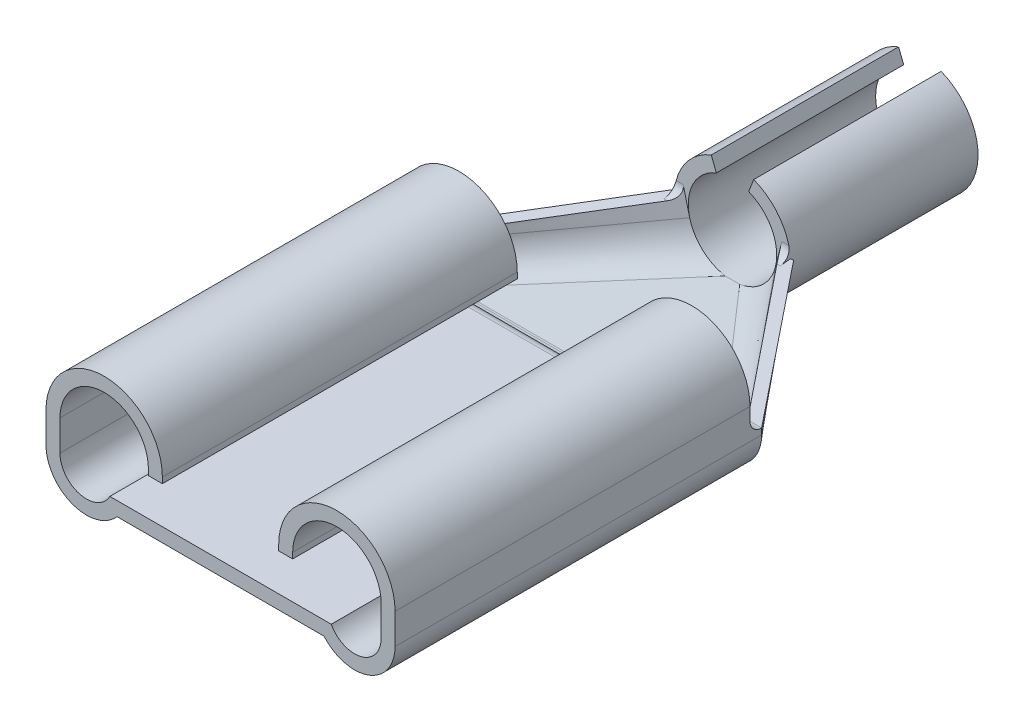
ISO-10303-21;
HEADER;
FILE_DESCRIPTION(('STEP AP214'),'2;1');
FILE_NAME('part.step','',(''),(''),'','','');
FILE_SCHEMA(('AUTOMOTIVE_DESIGN { 1 0 10303 214 1 1 1 1 }'));
ENDSEC;
DATA;
#1=APPLICATION_CONTEXT('core data for automotive mechanical design processes');
#2=APPLICATION_PROTOCOL_DEFINITION('international standard','automotive_design',2000,#1);
#3=PRODUCT_CONTEXT('',#1,'mechanical');
#4=PRODUCT('Part','Part','',(#3));
#5=PRODUCT_RELATED_PRODUCT_CATEGORY('part','',(#4));
#6=PRODUCT_DEFINITION_FORMATION('','',#4);
#7=PRODUCT_DEFINITION_CONTEXT('part definition',#1,'design');
#8=PRODUCT_DEFINITION('design','',#6,#7);
#9=PRODUCT_DEFINITION_SHAPE('','',#8);
#10=(LENGTH_UNIT() NAMED_UNIT(*) SI_UNIT(.MILLI.,.METRE.));
#11=(NAMED_UNIT(*) PLANE_ANGLE_UNIT() SI_UNIT($,.RADIAN.));
#12=(NAMED_UNIT(*) SI_UNIT($,.STERADIAN.) SOLID_ANGLE_UNIT());
#13=UNCERTAINTY_MEASURE_WITH_UNIT(LENGTH_MEASURE(1.E-05),#10,'distance_accuracy_value','');
#14=(GEOMETRIC_REPRESENTATION_CONTEXT(3) GLOBAL_UNCERTAINTY_ASSIGNED_CONTEXT((#13)) GLOBAL_UNIT_ASSIGNED_CONTEXT((#10,
#11,#12)) REPRESENTATION_CONTEXT('',''));
#15=CARTESIAN_POINT('',(0.,0.,0.));
#16=DIRECTION('',(0.,0.,1.));
#17=DIRECTION('',(1.,0.,0.));
#18=AXIS2_PLACEMENT_3D('',#15,#16,#17);
#19=CARTESIAN_POINT('',(0.,0.965200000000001,-3.429));
#20=DIRECTION('',(0.,0.,1.));
#21=DIRECTION('',(1.,0.,0.));
#22=AXIS2_PLACEMENT_3D('',#19,#20,#21);
#23=PLANE('',#22);
#24=CARTESIAN_POINT('',(0.,0.9652,-3.429));
#25=DIRECTION('',(0.,0.,1.));
#26=DIRECTION('',(-1.,0.,0.));
#27=AXIS2_PLACEMENT_3D('',#24,#25,#26);
#28=CIRCLE('',#27,0.9652);
#29=CARTESIAN_POINT('',(-0.156060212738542,0.0126999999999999,-3.429));
#30=VERTEX_POINT('',#29);
#31=CARTESIAN_POINT('',(0.156060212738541,0.0126999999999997,-3.429));
#32=VERTEX_POINT('',#31);
#33=EDGE_CURVE('E1201',#30,#32,#28,.T.);
#34=ORIENTED_EDGE('',*,*,#33,.F.);
#35=DIRECTION('',(-1.,0.,0.));
#36=VECTOR('',#35,1.);
#37=CARTESIAN_POINT('',(-0.156060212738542,0.0126999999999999,-3.429));
#38=LINE('',#37,#36);
#39=EDGE_CURVE('E1209',#32,#30,#38,.T.);
#40=ORIENTED_EDGE('',*,*,#39,.F.);
#41=EDGE_LOOP('',(#34,#40));
#42=FACE_BOUND('',#41,.T.);
#43=ADVANCED_FACE('F864',(#42),#23,.F.);
#44=CARTESIAN_POINT('',(0.,0.9652,-3.429));
#45=DIRECTION('',(0.,0.,-1.));
#46=DIRECTION('',(-1.,0.,0.));
#47=AXIS2_PLACEMENT_3D('',#44,#45,#46);
#48=CIRCLE('',#47,1.27);
#49=CARTESIAN_POINT('',(1.26696196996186,1.05299160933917,-3.429));
#50=VERTEX_POINT('',#49);
#51=CARTESIAN_POINT('',(1.23024282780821,0.64991824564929,-3.429));
#52=VERTEX_POINT('',#51);
#53=EDGE_CURVE('E1206',#50,#52,#48,.T.);
#54=ORIENTED_EDGE('',*,*,#53,.F.);
#55=DIRECTION('',(-1.,0.,0.));
#56=VECTOR('',#55,1.);
#57=CARTESIAN_POINT('',(1.33354087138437,1.05299160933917,-3.429));
#58=LINE('',#57,#56);
#59=CARTESIAN_POINT('',(1.33354087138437,1.05299160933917,-3.429));
#60=VERTEX_POINT('',#59);
#61=EDGE_CURVE('E1240',#60,#50,#58,.T.);
#62=ORIENTED_EDGE('',*,*,#61,.F.);
#63=DIRECTION('',(0.248253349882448,0.968695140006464,0.));
#64=VECTOR('',#63,1.);
#65=CARTESIAN_POINT('',(1.23024282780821,0.64991824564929,-3.429));
#66=LINE('',#65,#64);
#67=EDGE_CURVE('E1179',#52,#60,#66,.T.);
#68=ORIENTED_EDGE('',*,*,#67,.F.);
#69=EDGE_LOOP('',(#54,#62,#68));
#70=FACE_BOUND('',#69,.T.);
#71=ADVANCED_FACE('F1519',(#70),#23,.F.);
#72=CARTESIAN_POINT('',(-1.23024282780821,0.649918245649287,-3.429));
#73=VERTEX_POINT('',#72);
#74=CARTESIAN_POINT('',(-1.26696196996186,1.05299160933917,-3.429));
#75=VERTEX_POINT('',#74);
#76=EDGE_CURVE('E1195',#73,#75,#48,.T.);
#77=ORIENTED_EDGE('',*,*,#76,.F.);
#78=DIRECTION('',(0.248253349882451,-0.968695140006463,0.));
#79=VECTOR('',#78,1.);
#80=CARTESIAN_POINT('',(-1.23024282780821,0.649918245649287,-3.429));
#81=LINE('',#80,#79);
#82=CARTESIAN_POINT('',(-1.33354087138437,1.05299160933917,-3.429));
#83=VERTEX_POINT('',#82);
#84=EDGE_CURVE('E1243',#83,#73,#81,.T.);
#85=ORIENTED_EDGE('',*,*,#84,.F.);
#86=DIRECTION('',(-1.,0.,0.));
#87=VECTOR('',#86,1.);
#88=CARTESIAN_POINT('',(-1.01889079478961,1.05299160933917,-3.429));
#89=LINE('',#88,#87);
#90=EDGE_CURVE('E1235',#75,#83,#89,.T.);
#91=ORIENTED_EDGE('',*,*,#90,.F.);
#92=EDGE_LOOP('',(#77,#85,#91));
#93=FACE_BOUND('',#92,.T.);
#94=ADVANCED_FACE('F1463',(#93),#23,.F.);
#95=CARTESIAN_POINT('',(-2.92633948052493,0.578860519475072,7.747));
#96=DIRECTION('',(0.,0.,-1.));
#97=DIRECTION('',(-1.,0.,0.));
#98=AXIS2_PLACEMENT_3D('',#95,#96,#97);
#99=CYLINDRICAL_SURFACE('',#98,0.883660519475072);
#100=CARTESIAN_POINT('',(-2.30635275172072,-0.0507999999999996,0.762));
#101=CARTESIAN_POINT('',(-2.3168360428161,-0.061124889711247,0.761996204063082));
#102=CARTESIAN_POINT('',(-2.32756764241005,-0.0711731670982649,0.761371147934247));
#103=CARTESIAN_POINT('',(-2.34943194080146,-0.090651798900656,0.759046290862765));
#104=CARTESIAN_POINT('',(-2.36056383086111,-0.100083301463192,0.757348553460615));
#105=CARTESIAN_POINT('',(-2.39427103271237,-0.127246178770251,0.750932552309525));
#106=CARTESIAN_POINT('',(-2.41735320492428,-0.144037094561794,0.744885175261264));
#107=CARTESIAN_POINT('',(-2.47636154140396,-0.182834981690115,0.726519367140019));
#108=CARTESIAN_POINT('',(-2.51286491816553,-0.203168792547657,0.712575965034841));
#109=CARTESIAN_POINT('',(-2.58721618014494,-0.238178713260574,0.681095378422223));
#110=CARTESIAN_POINT('',(-2.62507082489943,-0.252820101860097,0.663537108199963));
#111=CARTESIAN_POINT('',(-2.70577168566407,-0.277988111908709,0.624217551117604));
#112=CARTESIAN_POINT('',(-2.74869684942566,-0.287859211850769,0.602205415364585));
#113=CARTESIAN_POINT('',(-2.83479559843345,-0.301120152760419,0.557061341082));
#114=CARTESIAN_POINT('',(-2.87796808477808,-0.30452893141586,0.533932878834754));
#115=CARTESIAN_POINT('',(-2.92284638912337,-0.304794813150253,0.509872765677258));
#116=CARTESIAN_POINT('',(-2.92459297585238,-0.304799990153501,0.508936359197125));
#117=CARTESIAN_POINT('',(-2.92633948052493,-0.3048,0.508));
#118=B_SPLINE_CURVE_WITH_KNOTS('',3,(#100,#101,#102,#103,#104,#105,#106,#107,#108,#109,#110,
#111,#112,#113,#114,#115,#116,#117),.UNSPECIFIED.,.F.,.F.,(4,2,2,2,2,2,2,2,4),(0.,
0.0440981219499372,0.0881116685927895,0.175328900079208,0.306777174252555,0.439015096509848,
0.586259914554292,0.733072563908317,0.73901786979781),.UNSPECIFIED.);
#119=CARTESIAN_POINT('',(-2.92633948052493,-0.3048,0.508));
#120=VERTEX_POINT('',#119);
#121=CARTESIAN_POINT('',(-2.43024073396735,-0.152400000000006,0.740794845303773));
#122=VERTEX_POINT('',#121);
#123=EDGE_CURVE('E1416',#120,#122,#118,.F.);
#124=ORIENTED_EDGE('',*,*,#123,.T.);
#125=CARTESIAN_POINT('',(-2.43024073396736,-0.1524,0.740794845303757));
#126=CARTESIAN_POINT('',(-2.42164141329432,-0.146566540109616,0.743344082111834));
#127=CARTESIAN_POINT('',(-2.41321023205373,-0.140624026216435,0.746195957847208));
#128=CARTESIAN_POINT('',(-2.39671099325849,-0.12856767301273,0.752614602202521));
#129=CARTESIAN_POINT('',(-2.3886441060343,-0.122453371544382,0.756183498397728));
#130=CARTESIAN_POINT('',(-2.36496558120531,-0.103866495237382,0.76817738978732));
#131=CARTESIAN_POINT('',(-2.35003357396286,-0.0912577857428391,0.777847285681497));
#132=CARTESIAN_POINT('',(-2.3277173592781,-0.0712518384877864,0.79685687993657));
#133=CARTESIAN_POINT('',(-2.31955833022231,-0.0636212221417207,0.805047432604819));
#134=CARTESIAN_POINT('',(-2.30453607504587,-0.0490921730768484,0.8230512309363));
#135=CARTESIAN_POINT('',(-2.29766812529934,-0.0421911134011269,0.832858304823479));
#136=CARTESIAN_POINT('',(-2.28535941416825,-0.0294815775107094,0.854162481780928));
#137=CARTESIAN_POINT('',(-2.27993507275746,-0.0236858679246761,0.865676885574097));
#138=CARTESIAN_POINT('',(-2.27083254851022,-0.0137711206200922,0.890052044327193));
#139=CARTESIAN_POINT('',(-2.26715298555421,-0.00965075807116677,0.902911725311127));
#140=CARTESIAN_POINT('',(-2.26252425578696,-0.00441801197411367,0.925470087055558));
#141=CARTESIAN_POINT('',(-2.2610859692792,-0.00277287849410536,0.934949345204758));
#142=CARTESIAN_POINT('',(-2.25915901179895,-0.000558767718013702,0.95414512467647));
#143=CARTESIAN_POINT('',(-2.25867215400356,8.15473169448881E-06,0.963862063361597));
#144=CARTESIAN_POINT('',(-2.25867458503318,0.,0.973589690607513));
#145=B_SPLINE_CURVE_WITH_KNOTS('',3,(#125,#126,#127,#128,#129,#130,#131,#132,#133,#134,#135,
#136,#137,#138,#139,#140,#141,#142,#143,#144),.UNSPECIFIED.,.F.,.F.,(4,2,2,2,2,2,2,2,2,4),(0.,
0.032080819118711,0.0642582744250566,0.129193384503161,0.17060743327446,0.211866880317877,
0.253577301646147,0.295254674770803,0.324334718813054,0.353470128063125),.UNSPECIFIED.);
#146=CARTESIAN_POINT('',(-2.25867458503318,0.,0.973589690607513));
#147=VERTEX_POINT('',#146);
#148=EDGE_CURVE('E1451',#122,#147,#145,.T.);
#149=ORIENTED_EDGE('',*,*,#148,.T.);
#150=DIRECTION('',(0.,0.,-1.));
#151=VECTOR('',#150,1.);
#152=CARTESIAN_POINT('',(-2.25867458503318,0.,7.747));
#153=LINE('',#152,#151);
#154=CARTESIAN_POINT('',(-2.25867458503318,0.,7.747));
#155=VERTEX_POINT('',#154);
#156=EDGE_CURVE('E1682',#155,#147,#153,.T.);
#157=ORIENTED_EDGE('',*,*,#156,.F.);
#158=CARTESIAN_POINT('',(-2.92633948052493,0.578860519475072,7.747));
#159=DIRECTION('',(0.,0.,1.));
#160=DIRECTION('',(1.,0.,0.));
#161=AXIS2_PLACEMENT_3D('',#158,#159,#160);
#162=CIRCLE('',#161,0.883660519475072);
#163=CARTESIAN_POINT('',(-3.81,0.578860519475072,7.747));
#164=VERTEX_POINT('',#163);
#165=EDGE_CURVE('E1609',#164,#155,#162,.T.);
#166=ORIENTED_EDGE('',*,*,#165,.F.);
#167=DIRECTION('',(0.,0.,-1.));
#168=VECTOR('',#167,1.);
#169=CARTESIAN_POINT('',(-3.81,0.578860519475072,7.747));
#170=LINE('',#169,#168);
#171=CARTESIAN_POINT('',(-3.81,0.578860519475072,-0.254));
#172=VERTEX_POINT('',#171);
#173=EDGE_CURVE('E1680',#164,#172,#170,.T.);
#174=ORIENTED_EDGE('',*,*,#173,.T.);
#175=CARTESIAN_POINT('',(-2.92633948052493,0.578860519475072,-0.254));
#176=DIRECTION('',(0.,0.,-1.));
#177=DIRECTION('',(-1.,0.,0.));
#178=AXIS2_PLACEMENT_3D('',#175,#176,#177);
#179=CIRCLE('',#178,0.883660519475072);
#180=CARTESIAN_POINT('',(-2.92633948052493,-0.3048,-0.254));
#181=VERTEX_POINT('',#180);
#182=EDGE_CURVE('E1246',#181,#172,#179,.T.);
#183=ORIENTED_EDGE('',*,*,#182,.F.);
#184=DIRECTION('',(0.,0.,1.));
#185=VECTOR('',#184,1.);
#186=CARTESIAN_POINT('',(-2.92633948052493,-0.3048,-0.254));
#187=LINE('',#186,#185);
#188=EDGE_CURVE('E1562',#181,#120,#187,.T.);
#189=ORIENTED_EDGE('',*,*,#188,.T.);
#190=EDGE_LOOP('',(#124,#149,#157,#166,#174,#183,#189));
#191=FACE_BOUND('',#190,.T.);
#192=ADVANCED_FACE('F1459',(#191),#99,.T.);
#193=CARTESIAN_POINT('',(-2.25867458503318,0.,7.747));
#194=DIRECTION('',(0.,1.,0.));
#195=DIRECTION('',(0.,0.,1.));
#196=AXIS2_PLACEMENT_3D('',#193,#194,#195);
#197=PLANE('',#196);
#198=ORIENTED_EDGE('',*,*,#156,.T.);
#199=DIRECTION('',(-1.,0.,0.));
#200=VECTOR('',#199,1.);
#201=CARTESIAN_POINT('',(-2.25867458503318,0.,0.973589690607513));
#202=LINE('',#201,#200);
#203=CARTESIAN_POINT('',(2.25867458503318,0.,0.973589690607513));
#204=VERTEX_POINT('',#203);
#205=EDGE_CURVE('E1430',#147,#204,#202,.F.);
#206=ORIENTED_EDGE('',*,*,#205,.T.);
#207=DIRECTION('',(0.,0.,-1.));
#208=VECTOR('',#207,1.);
#209=CARTESIAN_POINT('',(2.25867458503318,0.,7.747));
#210=LINE('',#209,#208);
#211=CARTESIAN_POINT('',(2.25867458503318,0.,7.747));
#212=VERTEX_POINT('',#211);
#213=EDGE_CURVE('E1685',#212,#204,#210,.T.);
#214=ORIENTED_EDGE('',*,*,#213,.F.);
#215=DIRECTION('',(1.,0.,0.));
#216=VECTOR('',#215,1.);
#217=CARTESIAN_POINT('',(-2.25867458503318,0.,7.747));
#218=LINE('',#217,#216);
#219=EDGE_CURVE('E1607',#155,#212,#218,.T.);
#220=ORIENTED_EDGE('',*,*,#219,.F.);
#221=EDGE_LOOP('',(#198,#206,#214,#220));
#222=FACE_BOUND('',#221,.T.);
#223=ADVANCED_FACE('F1440',(#222),#197,.F.);
#224=CARTESIAN_POINT('',(-2.92633948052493,0.578860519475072,0.));
#225=DIRECTION('',(0.,0.,1.));
#226=DIRECTION('',(1.,0.,0.));
#227=AXIS2_PLACEMENT_3D('',#224,#225,#226);
#228=PLANE('',#227);
#229=DIRECTION('',(0.,-1.,0.));
#230=VECTOR('',#229,1.);
#231=CARTESIAN_POINT('',(-3.5052,1.2446,0.));
#232=LINE('',#231,#230);
#233=CARTESIAN_POINT('',(-3.5052,1.2446,0.));
#234=VERTEX_POINT('',#233);
#235=CARTESIAN_POINT('',(-3.5052,0.9652,0.));
#236=VERTEX_POINT('',#235);
#237=EDGE_CURVE('E1583',#234,#236,#232,.T.);
#238=ORIENTED_EDGE('',*,*,#237,.T.);
#239=DIRECTION('',(1.,0.,0.));
#240=VECTOR('',#239,1.);
#241=CARTESIAN_POINT('',(-3.81,0.9652,0.));
#242=LINE('',#241,#240);
#243=CARTESIAN_POINT('',(-3.81,0.9652,0.));
#244=VERTEX_POINT('',#243);
#245=EDGE_CURVE('E2160',#236,#244,#242,.F.);
#246=ORIENTED_EDGE('',*,*,#245,.T.);
#247=DIRECTION('',(0.,-1.,0.));
#248=VECTOR('',#247,1.);
#249=CARTESIAN_POINT('',(-3.81,1.2446,0.));
#250=LINE('',#249,#248);
#251=CARTESIAN_POINT('',(-3.81,1.2446,0.));
#252=VERTEX_POINT('',#251);
#253=EDGE_CURVE('E1647',#252,#244,#250,.T.);
#254=ORIENTED_EDGE('',*,*,#253,.F.);
#255=CARTESIAN_POINT('',(-2.54,1.2446,0.));
#256=DIRECTION('',(0.,0.,-1.));
#257=DIRECTION('',(-1.,0.,0.));
#258=AXIS2_PLACEMENT_3D('',#255,#256,#257);
#259=CIRCLE('',#258,1.27);
#260=CARTESIAN_POINT('',(-1.27,1.2446,0.));
#261=VERTEX_POINT('',#260);
#262=EDGE_CURVE('E1650',#252,#261,#259,.T.);
#263=ORIENTED_EDGE('',*,*,#262,.T.);
#264=DIRECTION('',(0.,-1.,0.));
#265=VECTOR('',#264,1.);
#266=CARTESIAN_POINT('',(-1.27,1.2446,0.));
#267=LINE('',#266,#265);
#268=CARTESIAN_POINT('',(-1.27,1.1176,0.));
#269=VERTEX_POINT('',#268);
#270=EDGE_CURVE('E1653',#261,#269,#267,.T.);
#271=ORIENTED_EDGE('',*,*,#270,.T.);
#272=DIRECTION('',(-1.,0.,0.));
#273=VECTOR('',#272,1.);
#274=CARTESIAN_POINT('',(-1.27,1.1176,0.));
#275=LINE('',#274,#273);
#276=CARTESIAN_POINT('',(-1.5748,1.1176,0.));
#277=VERTEX_POINT('',#276);
#278=EDGE_CURVE('E1656',#269,#277,#275,.T.);
#279=ORIENTED_EDGE('',*,*,#278,.T.);
#280=DIRECTION('',(0.,-1.,0.));
#281=VECTOR('',#280,1.);
#282=CARTESIAN_POINT('',(-1.5748,1.2446,0.));
#283=LINE('',#282,#281);
#284=CARTESIAN_POINT('',(-1.5748,1.2446,0.));
#285=VERTEX_POINT('',#284);
#286=EDGE_CURVE('E1659',#285,#277,#283,.T.);
#287=ORIENTED_EDGE('',*,*,#286,.F.);
#288=CARTESIAN_POINT('',(-2.54,1.2446,0.));
#289=DIRECTION('',(0.,0.,-1.));
#290=DIRECTION('',(-1.,0.,0.));
#291=AXIS2_PLACEMENT_3D('',#288,#289,#290);
#292=CIRCLE('',#291,0.9652);
#293=EDGE_CURVE('E1662',#234,#285,#292,.T.);
#294=ORIENTED_EDGE('',*,*,#293,.F.);
#295=EDGE_LOOP('',(#238,#246,#254,#263,#271,#279,#287,#294));
#296=FACE_BOUND('',#295,.T.);
#297=ADVANCED_FACE('F1494',(#296),#228,.F.);
#298=DIRECTION('',(0.,-1.,0.));
#299=VECTOR('',#298,1.);
#300=CARTESIAN_POINT('',(3.81,1.2446,0.));
#301=LINE('',#300,#299);
#302=CARTESIAN_POINT('',(3.81,1.2446,0.));
#303=VERTEX_POINT('',#302);
#304=CARTESIAN_POINT('',(3.81,0.965200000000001,0.));
#305=VERTEX_POINT('',#304);
#306=EDGE_CURVE('E1644',#303,#305,#301,.T.);
#307=ORIENTED_EDGE('',*,*,#306,.T.);
#308=DIRECTION('',(1.,0.,0.));
#309=VECTOR('',#308,1.);
#310=CARTESIAN_POINT('',(3.5052,0.9652,0.));
#311=LINE('',#310,#309);
#312=CARTESIAN_POINT('',(3.5052,0.965200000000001,0.));
#313=VERTEX_POINT('',#312);
#314=EDGE_CURVE('E1205',#305,#313,#311,.F.);
#315=ORIENTED_EDGE('',*,*,#314,.T.);
#316=DIRECTION('',(0.,-1.,0.));
#317=VECTOR('',#316,1.);
#318=CARTESIAN_POINT('',(3.5052,1.2446,0.));
#319=LINE('',#318,#317);
#320=CARTESIAN_POINT('',(3.5052,1.2446,0.));
#321=VERTEX_POINT('',#320);
#322=EDGE_CURVE('E1578',#321,#313,#319,.T.);
#323=ORIENTED_EDGE('',*,*,#322,.F.);
#324=CARTESIAN_POINT('',(2.54,1.2446,0.));
#325=DIRECTION('',(0.,0.,1.));
#326=DIRECTION('',(1.,0.,0.));
#327=AXIS2_PLACEMENT_3D('',#324,#325,#326);
#328=CIRCLE('',#327,0.9652);
#329=CARTESIAN_POINT('',(1.5748,1.2446,0.));
#330=VERTEX_POINT('',#329);
#331=EDGE_CURVE('E1631',#321,#330,#328,.T.);
#332=ORIENTED_EDGE('',*,*,#331,.T.);
#333=DIRECTION('',(0.,-1.,0.));
#334=VECTOR('',#333,1.);
#335=CARTESIAN_POINT('',(1.5748,1.2446,0.));
#336=LINE('',#335,#334);
#337=CARTESIAN_POINT('',(1.5748,1.1176,0.));
#338=VERTEX_POINT('',#337);
#339=EDGE_CURVE('E1634',#330,#338,#336,.T.);
#340=ORIENTED_EDGE('',*,*,#339,.T.);
#341=DIRECTION('',(1.,0.,0.));
#342=VECTOR('',#341,1.);
#343=CARTESIAN_POINT('',(1.27,1.1176,0.));
#344=LINE('',#343,#342);
#345=CARTESIAN_POINT('',(1.27,1.1176,0.));
#346=VERTEX_POINT('',#345);
#347=EDGE_CURVE('E1637',#346,#338,#344,.T.);
#348=ORIENTED_EDGE('',*,*,#347,.F.);
#349=DIRECTION('',(0.,-1.,0.));
#350=VECTOR('',#349,1.);
#351=CARTESIAN_POINT('',(1.27,1.2446,0.));
#352=LINE('',#351,#350);
#353=CARTESIAN_POINT('',(1.27,1.2446,0.));
#354=VERTEX_POINT('',#353);
#355=EDGE_CURVE('E1640',#354,#346,#352,.T.);
#356=ORIENTED_EDGE('',*,*,#355,.F.);
#357=CARTESIAN_POINT('',(2.54,1.2446,0.));
#358=DIRECTION('',(0.,0.,1.));
#359=DIRECTION('',(1.,0.,0.));
#360=AXIS2_PLACEMENT_3D('',#357,#358,#359);
#361=CIRCLE('',#360,1.27);
#362=EDGE_CURVE('E1642',#303,#354,#361,.T.);
#363=ORIENTED_EDGE('',*,*,#362,.F.);
#364=EDGE_LOOP('',(#307,#315,#323,#332,#340,#348,#356,#363));
#365=FACE_BOUND('',#364,.T.);
#366=ADVANCED_FACE('F1497',(#365),#228,.F.);
#367=CARTESIAN_POINT('',(-2.92633948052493,0.578860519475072,7.747));
#368=DIRECTION('',(0.,0.,-1.));
#369=DIRECTION('',(-1.,0.,0.));
#370=AXIS2_PLACEMENT_3D('',#367,#368,#369);
#371=CYLINDRICAL_SURFACE('',#370,0.578860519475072);
#372=DIRECTION('',(0.,0.,-1.));
#373=VECTOR('',#372,1.);
#374=CARTESIAN_POINT('',(-2.41646662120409,0.304799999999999,7.747));
#375=LINE('',#374,#373);
#376=CARTESIAN_POINT('',(-2.41646662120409,0.304799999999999,7.747));
#377=VERTEX_POINT('',#376);
#378=CARTESIAN_POINT('',(-2.41646662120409,0.304799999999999,0.254));
#379=VERTEX_POINT('',#378);
#380=EDGE_CURVE('E1193',#377,#379,#375,.T.);
#381=ORIENTED_EDGE('',*,*,#380,.T.);
#382=CARTESIAN_POINT('',(-2.41646662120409,0.304799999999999,0.254));
#383=CARTESIAN_POINT('',(-2.41647122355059,0.304816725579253,0.241315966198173));
#384=CARTESIAN_POINT('',(-2.41697696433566,0.303850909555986,0.22863634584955));
#385=CARTESIAN_POINT('',(-2.41902562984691,0.30007670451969,0.203660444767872));
#386=CARTESIAN_POINT('',(-2.42056690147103,0.297271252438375,0.191363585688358));
#387=CARTESIAN_POINT('',(-2.42472226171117,0.28993791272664,0.167479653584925));
#388=CARTESIAN_POINT('',(-2.42733683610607,0.285409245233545,0.155892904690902));
#389=CARTESIAN_POINT('',(-2.43368706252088,0.274868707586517,0.133752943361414));
#390=CARTESIAN_POINT('',(-2.4374224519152,0.268857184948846,0.12319948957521));
#391=CARTESIAN_POINT('',(-2.44608051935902,0.25560568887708,0.103284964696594));
#392=CARTESIAN_POINT('',(-2.45101353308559,0.248355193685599,0.0939354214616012));
#393=CARTESIAN_POINT('',(-2.46203418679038,0.233044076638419,0.0766975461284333));
#394=CARTESIAN_POINT('',(-2.46812220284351,0.224983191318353,0.0688096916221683));
#395=CARTESIAN_POINT('',(-2.48182181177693,0.207901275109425,0.0540732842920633));
#396=CARTESIAN_POINT('',(-2.48950705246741,0.198851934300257,0.0473265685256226));
#397=CARTESIAN_POINT('',(-2.50598106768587,0.180703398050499,0.0354619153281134));
#398=CARTESIAN_POINT('',(-2.51477019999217,0.171604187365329,0.0303445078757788));
#399=CARTESIAN_POINT('',(-2.53802495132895,0.149130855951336,0.0193218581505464));
#400=CARTESIAN_POINT('',(-2.55310338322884,0.135937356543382,0.0143406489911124));
#401=CARTESIAN_POINT('',(-2.58496551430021,0.110932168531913,0.0068731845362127));
#402=CARTESIAN_POINT('',(-2.60175487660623,0.0991253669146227,0.00439553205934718));
#403=CARTESIAN_POINT('',(-2.63041355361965,0.0811821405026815,0.00172347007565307));
#404=CARTESIAN_POINT('',(-2.64191793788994,0.0745190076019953,0.00103108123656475));
#405=CARTESIAN_POINT('',(-2.66529147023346,0.0620355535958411,0.000172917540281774));
#406=CARTESIAN_POINT('',(-2.67715748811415,0.0562096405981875,3.47741100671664E-06));
#407=CARTESIAN_POINT('',(-2.68920747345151,0.0507999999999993,0.));
#408=B_SPLINE_CURVE_WITH_KNOTS('',3,(#382,#383,#384,#385,#386,#387,#388,#389,#390,#391,#392,
#393,#394,#395,#396,#397,#398,#399,#400,#401,#402,#403,#404,#405,#406,#407),.UNSPECIFIED.,.F.,
.F.,(4,2,2,2,2,2,2,2,2,2,2,2,4),(0.,0.037998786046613,0.0759370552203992,0.113892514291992,
0.151839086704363,0.190125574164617,0.228424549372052,0.269230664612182,0.310050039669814,
0.371639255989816,0.433439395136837,0.473338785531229,0.512957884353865),.UNSPECIFIED.);
#409=CARTESIAN_POINT('',(-2.53491780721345,0.152400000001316,0.0212051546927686));
#410=VERTEX_POINT('',#409);
#411=EDGE_CURVE('E1715',#379,#410,#408,.T.);
#412=ORIENTED_EDGE('',*,*,#411,.T.);
#413=CARTESIAN_POINT('',(-2.53491780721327,0.1524,0.0212051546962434));
#414=CARTESIAN_POINT('',(-2.54524963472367,0.14291759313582,0.0170623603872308));
#415=CARTESIAN_POINT('',(-2.5558104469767,0.133915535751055,0.0124486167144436));
#416=CARTESIAN_POINT('',(-2.57729648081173,0.116868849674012,0.00244063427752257));
#417=CARTESIAN_POINT('',(-2.58822104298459,0.10882259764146,-0.00295224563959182));
#418=CARTESIAN_POINT('',(-2.62134891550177,0.0861390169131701,-0.0200277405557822));
#419=CARTESIAN_POINT('',(-2.64400681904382,0.0728664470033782,-0.0326498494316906));
#420=CARTESIAN_POINT('',(-2.69944065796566,0.0450890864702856,-0.0649809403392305));
#421=CARTESIAN_POINT('',(-2.73258723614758,0.0322746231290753,-0.0854856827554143));
#422=CARTESIAN_POINT('',(-2.79965434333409,0.0129546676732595,-0.128153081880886));
#423=CARTESIAN_POINT('',(-2.83357581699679,0.00645734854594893,-0.15031784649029));
#424=CARTESIAN_POINT('',(-2.88582284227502,0.00112984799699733,-0.184755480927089));
#425=CARTESIAN_POINT('',(-2.90407593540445,0.000140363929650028,-0.196842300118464));
#426=CARTESIAN_POINT('',(-2.92366508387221,4.63553910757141E-06,-0.20981812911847));
#427=CARTESIAN_POINT('',(-2.92500229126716,2.70449127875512E-09,-0.210703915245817));
#428=CARTESIAN_POINT('',(-2.92633948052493,0.,-0.211589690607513));
#429=B_SPLINE_CURVE_WITH_KNOTS('',3,(#413,#414,#415,#416,#417,#418,#419,#420,#421,#422,#423,
#424,#425,#426,#427,#428),.UNSPECIFIED.,.F.,.F.,(4,2,2,2,2,2,2,4),(0.,0.0438256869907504,
0.0875758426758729,0.174656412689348,0.297117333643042,0.419736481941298,0.485415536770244,
0.490227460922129),.UNSPECIFIED.);
#430=CARTESIAN_POINT('',(-2.92633948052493,0.,-0.211589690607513));
#431=VERTEX_POINT('',#430);
#432=EDGE_CURVE('E12',#410,#431,#429,.T.);
#433=ORIENTED_EDGE('',*,*,#432,.T.);
#434=DIRECTION('',(0.,0.,1.));
#435=VECTOR('',#434,1.);
#436=CARTESIAN_POINT('',(-2.92633948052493,0.,-0.254));
#437=LINE('',#436,#435);
#438=CARTESIAN_POINT('',(-2.92633948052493,0.,-0.254));
#439=VERTEX_POINT('',#438);
#440=EDGE_CURVE('E1575',#439,#431,#437,.T.);
#441=ORIENTED_EDGE('',*,*,#440,.F.);
#442=CARTESIAN_POINT('',(-2.92633948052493,0.578860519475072,-0.254));
#443=DIRECTION('',(0.,0.,1.));
#444=DIRECTION('',(-1.,0.,0.));
#445=AXIS2_PLACEMENT_3D('',#442,#443,#444);
#446=CIRCLE('',#445,0.578860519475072);
#447=CARTESIAN_POINT('',(-3.5052,0.578860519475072,-0.254));
#448=VERTEX_POINT('',#447);
#449=EDGE_CURVE('E2196',#448,#439,#446,.T.);
#450=ORIENTED_EDGE('',*,*,#449,.F.);
#451=DIRECTION('',(0.,0.,-1.));
#452=VECTOR('',#451,1.);
#453=CARTESIAN_POINT('',(-3.5052,0.578860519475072,7.747));
#454=LINE('',#453,#452);
#455=CARTESIAN_POINT('',(-3.5052,0.578860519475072,7.747));
#456=VERTEX_POINT('',#455);
#457=EDGE_CURVE('E1535',#456,#448,#454,.T.);
#458=ORIENTED_EDGE('',*,*,#457,.F.);
#459=CARTESIAN_POINT('',(-2.92633948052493,0.578860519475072,7.747));
#460=DIRECTION('',(0.,0.,1.));
#461=DIRECTION('',(1.,0.,0.));
#462=AXIS2_PLACEMENT_3D('',#459,#460,#461);
#463=CIRCLE('',#462,0.578860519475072);
#464=EDGE_CURVE('E1579',#456,#377,#463,.T.);
#465=ORIENTED_EDGE('',*,*,#464,.T.);
#466=EDGE_LOOP('',(#381,#412,#433,#441,#450,#458,#465));
#467=FACE_BOUND('',#466,.T.);
#468=ADVANCED_FACE('F1492',(#467),#371,.F.);
#469=CARTESIAN_POINT('',(-3.5052,1.2446,7.747));
#470=DIRECTION('',(1.,0.,0.));
#471=DIRECTION('',(0.,1.,0.));
#472=AXIS2_PLACEMENT_3D('',#469,#470,#471);
#473=PLANE('',#472);
#474=DIRECTION('',(0.,-1.,0.));
#475=VECTOR('',#474,1.);
#476=CARTESIAN_POINT('',(-3.5052,0.7112,-0.254));
#477=LINE('',#476,#475);
#478=CARTESIAN_POINT('',(-3.5052,0.7112,-0.254));
#479=VERTEX_POINT('',#478);
#480=EDGE_CURVE('E2195',#479,#448,#477,.T.);
#481=ORIENTED_EDGE('',*,*,#480,.F.);
#482=CARTESIAN_POINT('',(-3.5052,0.9652,-0.254));
#483=DIRECTION('',(1.,0.,0.));
#484=DIRECTION('',(0.,1.,0.));
#485=AXIS2_PLACEMENT_3D('',#482,#483,#484);
#486=CIRCLE('',#485,0.254);
#487=EDGE_CURVE('E2167',#479,#236,#486,.F.);
#488=ORIENTED_EDGE('',*,*,#487,.T.);
#489=ORIENTED_EDGE('',*,*,#237,.F.);
#490=DIRECTION('',(0.,0.,-1.));
#491=VECTOR('',#490,1.);
#492=CARTESIAN_POINT('',(-3.5052,1.2446,7.747));
#493=LINE('',#492,#491);
#494=CARTESIAN_POINT('',(-3.5052,1.2446,7.747));
#495=VERTEX_POINT('',#494);
#496=EDGE_CURVE('E1667',#495,#234,#493,.T.);
#497=ORIENTED_EDGE('',*,*,#496,.F.);
#498=DIRECTION('',(0.,-1.,0.));
#499=VECTOR('',#498,1.);
#500=CARTESIAN_POINT('',(-3.5052,1.2446,7.747));
#501=LINE('',#500,#499);
#502=EDGE_CURVE('E1626',#495,#456,#501,.T.);
#503=ORIENTED_EDGE('',*,*,#502,.T.);
#504=ORIENTED_EDGE('',*,*,#457,.T.);
#505=EDGE_LOOP('',(#481,#488,#489,#497,#503,#504));
#506=FACE_BOUND('',#505,.T.);
#507=ADVANCED_FACE('F1488',(#506),#473,.T.);
#508=CARTESIAN_POINT('',(-2.54,1.2446,7.747));
#509=DIRECTION('',(0.,0.,-1.));
#510=DIRECTION('',(-1.,0.,0.));
#511=AXIS2_PLACEMENT_3D('',#508,#509,#510);
#512=CYLINDRICAL_SURFACE('',#511,0.9652);
#513=ORIENTED_EDGE('',*,*,#293,.T.);
#514=DIRECTION('',(0.,0.,-1.));
#515=VECTOR('',#514,1.);
#516=CARTESIAN_POINT('',(-1.5748,1.2446,7.747));
#517=LINE('',#516,#515);
#518=CARTESIAN_POINT('',(-1.5748,1.2446,7.747));
#519=VERTEX_POINT('',#518);
#520=EDGE_CURVE('E1669',#519,#285,#517,.T.);
#521=ORIENTED_EDGE('',*,*,#520,.F.);
#522=CARTESIAN_POINT('',(-2.54,1.2446,7.747));
#523=DIRECTION('',(0.,0.,-1.));
#524=DIRECTION('',(-1.,0.,0.));
#525=AXIS2_PLACEMENT_3D('',#522,#523,#524);
#526=CIRCLE('',#525,0.9652);
#527=EDGE_CURVE('E1624',#495,#519,#526,.T.);
#528=ORIENTED_EDGE('',*,*,#527,.F.);
#529=ORIENTED_EDGE('',*,*,#496,.T.);
#530=EDGE_LOOP('',(#513,#521,#528,#529));
#531=FACE_BOUND('',#530,.T.);
#532=ADVANCED_FACE('F1484',(#531),#512,.F.);
#533=CARTESIAN_POINT('',(-1.5748,1.2446,7.747));
#534=DIRECTION('',(1.,0.,0.));
#535=DIRECTION('',(0.,1.,0.));
#536=AXIS2_PLACEMENT_3D('',#533,#534,#535);
#537=PLANE('',#536);
#538=ORIENTED_EDGE('',*,*,#286,.T.);
#539=DIRECTION('',(0.,0.,-1.));
#540=VECTOR('',#539,1.);
#541=CARTESIAN_POINT('',(-1.5748,1.1176,7.747));
#542=LINE('',#541,#540);
#543=CARTESIAN_POINT('',(-1.5748,1.1176,7.747));
#544=VERTEX_POINT('',#543);
#545=EDGE_CURVE('E1672',#544,#277,#542,.T.);
#546=ORIENTED_EDGE('',*,*,#545,.F.);
#547=DIRECTION('',(0.,-1.,0.));
#548=VECTOR('',#547,1.);
#549=CARTESIAN_POINT('',(-1.5748,1.2446,7.747));
#550=LINE('',#549,#548);
#551=EDGE_CURVE('E1622',#519,#544,#550,.T.);
#552=ORIENTED_EDGE('',*,*,#551,.F.);
#553=ORIENTED_EDGE('',*,*,#520,.T.);
#554=EDGE_LOOP('',(#538,#546,#552,#553));
#555=FACE_BOUND('',#554,.T.);
#556=ADVANCED_FACE('F1480',(#555),#537,.F.);
#557=CARTESIAN_POINT('',(-1.27,1.1176,7.747));
#558=DIRECTION('',(0.,-1.,0.));
#559=DIRECTION('',(0.,0.,-1.));
#560=AXIS2_PLACEMENT_3D('',#557,#558,#559);
#561=PLANE('',#560);
#562=ORIENTED_EDGE('',*,*,#278,.F.);
#563=DIRECTION('',(0.,0.,-1.));
#564=VECTOR('',#563,1.);
#565=CARTESIAN_POINT('',(-1.27,1.1176,7.747));
#566=LINE('',#565,#564);
#567=CARTESIAN_POINT('',(-1.27,1.1176,7.747));
#568=VERTEX_POINT('',#567);
#569=EDGE_CURVE('E1674',#568,#269,#566,.T.);
#570=ORIENTED_EDGE('',*,*,#569,.F.);
#571=DIRECTION('',(-1.,0.,0.));
#572=VECTOR('',#571,1.);
#573=CARTESIAN_POINT('',(-1.27,1.1176,7.747));
#574=LINE('',#573,#572);
#575=EDGE_CURVE('E1619',#568,#544,#574,.T.);
#576=ORIENTED_EDGE('',*,*,#575,.T.);
#577=ORIENTED_EDGE('',*,*,#545,.T.);
#578=EDGE_LOOP('',(#562,#570,#576,#577));
#579=FACE_BOUND('',#578,.T.);
#580=ADVANCED_FACE('F1476',(#579),#561,.T.);
#581=CARTESIAN_POINT('',(-1.27,1.2446,7.747));
#582=DIRECTION('',(1.,0.,0.));
#583=DIRECTION('',(0.,1.,0.));
#584=AXIS2_PLACEMENT_3D('',#581,#582,#583);
#585=PLANE('',#584);
#586=ORIENTED_EDGE('',*,*,#270,.F.);
#587=DIRECTION('',(0.,0.,-1.));
#588=VECTOR('',#587,1.);
#589=CARTESIAN_POINT('',(-1.27,1.2446,7.747));
#590=LINE('',#589,#588);
#591=CARTESIAN_POINT('',(-1.27,1.2446,7.747));
#592=VERTEX_POINT('',#591);
#593=EDGE_CURVE('E1676',#592,#261,#590,.T.);
#594=ORIENTED_EDGE('',*,*,#593,.F.);
#595=DIRECTION('',(0.,-1.,0.));
#596=VECTOR('',#595,1.);
#597=CARTESIAN_POINT('',(-1.27,1.2446,7.747));
#598=LINE('',#597,#596);
#599=EDGE_CURVE('E1616',#592,#568,#598,.T.);
#600=ORIENTED_EDGE('',*,*,#599,.T.);
#601=ORIENTED_EDGE('',*,*,#569,.T.);
#602=EDGE_LOOP('',(#586,#594,#600,#601));
#603=FACE_BOUND('',#602,.T.);
#604=ADVANCED_FACE('F1472',(#603),#585,.T.);
#605=CARTESIAN_POINT('',(-2.54,1.2446,7.747));
#606=DIRECTION('',(0.,0.,-1.));
#607=DIRECTION('',(-1.,0.,0.));
#608=AXIS2_PLACEMENT_3D('',#605,#606,#607);
#609=CYLINDRICAL_SURFACE('',#608,1.27);
#610=ORIENTED_EDGE('',*,*,#262,.F.);
#611=DIRECTION('',(0.,0.,-1.));
#612=VECTOR('',#611,1.);
#613=CARTESIAN_POINT('',(-3.81,1.2446,7.747));
#614=LINE('',#613,#612);
#615=CARTESIAN_POINT('',(-3.81,1.2446,7.747));
#616=VERTEX_POINT('',#615);
#617=EDGE_CURVE('E1678',#616,#252,#614,.T.);
#618=ORIENTED_EDGE('',*,*,#617,.F.);
#619=CARTESIAN_POINT('',(-2.54,1.2446,7.747));
#620=DIRECTION('',(0.,0.,-1.));
#621=DIRECTION('',(-1.,0.,0.));
#622=AXIS2_PLACEMENT_3D('',#619,#620,#621);
#623=CIRCLE('',#622,1.27);
#624=EDGE_CURVE('E1613',#616,#592,#623,.T.);
#625=ORIENTED_EDGE('',*,*,#624,.T.);
#626=ORIENTED_EDGE('',*,*,#593,.T.);
#627=EDGE_LOOP('',(#610,#618,#625,#626));
#628=FACE_BOUND('',#627,.T.);
#629=ADVANCED_FACE('F1468',(#628),#609,.T.);
#630=CARTESIAN_POINT('',(-3.81,1.2446,7.747));
#631=DIRECTION('',(1.,0.,0.));
#632=DIRECTION('',(0.,1.,0.));
#633=AXIS2_PLACEMENT_3D('',#630,#631,#632);
#634=PLANE('',#633);
#635=ORIENTED_EDGE('',*,*,#253,.T.);
#636=CARTESIAN_POINT('',(-3.81,0.9652,-0.254));
#637=DIRECTION('',(1.,0.,0.));
#638=DIRECTION('',(0.,1.,0.));
#639=AXIS2_PLACEMENT_3D('',#636,#637,#638);
#640=CIRCLE('',#639,0.254);
#641=CARTESIAN_POINT('',(-3.81,0.7112,-0.254));
#642=VERTEX_POINT('',#641);
#643=EDGE_CURVE('E2169',#244,#642,#640,.T.);
#644=ORIENTED_EDGE('',*,*,#643,.T.);
#645=DIRECTION('',(0.,1.,0.));
#646=VECTOR('',#645,1.);
#647=CARTESIAN_POINT('',(-3.81,0.578860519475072,-0.254));
#648=LINE('',#647,#646);
#649=EDGE_CURVE('E2200',#172,#642,#648,.T.);
#650=ORIENTED_EDGE('',*,*,#649,.F.);
#651=ORIENTED_EDGE('',*,*,#173,.F.);
#652=DIRECTION('',(0.,-1.,0.));
#653=VECTOR('',#652,1.);
#654=CARTESIAN_POINT('',(-3.81,1.2446,7.747));
#655=LINE('',#654,#653);
#656=EDGE_CURVE('E1611',#616,#164,#655,.T.);
#657=ORIENTED_EDGE('',*,*,#656,.F.);
#658=ORIENTED_EDGE('',*,*,#617,.T.);
#659=EDGE_LOOP('',(#635,#644,#650,#651,#657,#658));
#660=FACE_BOUND('',#659,.T.);
#661=ADVANCED_FACE('F1438',(#660),#634,.F.);
#662=CARTESIAN_POINT('',(2.92633948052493,0.578860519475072,7.747));
#663=DIRECTION('',(0.,0.,-1.));
#664=DIRECTION('',(-1.,0.,0.));
#665=AXIS2_PLACEMENT_3D('',#662,#663,#664);
#666=CYLINDRICAL_SURFACE('',#665,0.883660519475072);
#667=ORIENTED_EDGE('',*,*,#213,.T.);
#668=CARTESIAN_POINT('',(2.25867458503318,0.,0.973589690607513));
#669=CARTESIAN_POINT('',(2.25866738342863,1.84860415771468E-05,0.962115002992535));
#670=CARTESIAN_POINT('',(2.25934767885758,-0.000776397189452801,0.950654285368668));
#671=CARTESIAN_POINT('',(2.26202362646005,-0.00384655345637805,0.928146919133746));
#672=CARTESIAN_POINT('',(2.26401272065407,-0.0061144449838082,0.917098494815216));
#673=CARTESIAN_POINT('',(2.26924536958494,-0.011984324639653,0.895690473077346));
#674=CARTESIAN_POINT('',(2.27248783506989,-0.0155851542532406,0.885330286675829));
#675=CARTESIAN_POINT('',(2.28013320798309,-0.0238876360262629,0.86551709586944));
#676=CARTESIAN_POINT('',(2.28453701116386,-0.028590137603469,0.856064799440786));
#677=CARTESIAN_POINT('',(2.29460862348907,-0.0390608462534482,0.83782232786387));
#678=CARTESIAN_POINT('',(2.30032429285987,-0.0448674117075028,0.829080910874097));
#679=CARTESIAN_POINT('',(2.31274586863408,-0.0570915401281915,0.812820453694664));
#680=CARTESIAN_POINT('',(2.31945234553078,-0.0635094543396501,0.805302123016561));
#681=CARTESIAN_POINT('',(2.33752732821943,-0.080212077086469,0.787771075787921));
#682=CARTESIAN_POINT('',(2.3494718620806,-0.0907302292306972,0.778572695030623));
#683=CARTESIAN_POINT('',(2.37488564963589,-0.111811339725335,0.762701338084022));
#684=CARTESIAN_POINT('',(2.38835769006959,-0.122374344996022,0.756033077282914));
#685=CARTESIAN_POINT('',(2.41146003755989,-0.139390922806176,0.746791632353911));
#686=CARTESIAN_POINT('',(2.42075524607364,-0.145971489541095,0.743605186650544));
#687=CARTESIAN_POINT('',(2.43024073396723,-0.152400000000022,0.740794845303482));
#688=B_SPLINE_CURVE_WITH_KNOTS('',3,(#668,#669,#670,#671,#672,#673,#674,#675,#676,#677,#678,
#679,#680,#681,#682,#683,#684,#685,#686,#687),.UNSPECIFIED.,.F.,.F.,(4,2,2,2,2,2,2,2,2,4),(0.,
0.0343544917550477,0.0685381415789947,0.102692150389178,0.136872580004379,0.172587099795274,
0.208322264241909,0.263155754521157,0.318090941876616,0.353513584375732),.UNSPECIFIED.);
#689=CARTESIAN_POINT('',(2.43024073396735,-0.152400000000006,0.740794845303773));
#690=VERTEX_POINT('',#689);
#691=EDGE_CURVE('E1443',#204,#690,#688,.T.);
#692=ORIENTED_EDGE('',*,*,#691,.T.);
#693=CARTESIAN_POINT('',(2.30635275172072,-0.0507999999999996,0.762));
#694=CARTESIAN_POINT('',(2.3168360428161,-0.061124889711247,0.761996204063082));
#695=CARTESIAN_POINT('',(2.32756764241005,-0.0711731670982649,0.761371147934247));
#696=CARTESIAN_POINT('',(2.34943194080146,-0.090651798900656,0.759046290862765));
#697=CARTESIAN_POINT('',(2.36056383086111,-0.100083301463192,0.757348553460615));
#698=CARTESIAN_POINT('',(2.39427103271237,-0.127246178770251,0.750932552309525));
#699=CARTESIAN_POINT('',(2.41735320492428,-0.144037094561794,0.744885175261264));
#700=CARTESIAN_POINT('',(2.47636154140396,-0.182834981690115,0.726519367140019));
#701=CARTESIAN_POINT('',(2.51286491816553,-0.203168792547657,0.712575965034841));
#702=CARTESIAN_POINT('',(2.58721618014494,-0.238178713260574,0.681095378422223));
#703=CARTESIAN_POINT('',(2.62507082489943,-0.252820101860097,0.663537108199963));
#704=CARTESIAN_POINT('',(2.70577168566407,-0.277988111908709,0.624217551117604));
#705=CARTESIAN_POINT('',(2.74869684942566,-0.287859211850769,0.602205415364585));
#706=CARTESIAN_POINT('',(2.83479559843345,-0.301120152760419,0.557061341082));
#707=CARTESIAN_POINT('',(2.87796808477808,-0.30452893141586,0.533932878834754));
#708=CARTESIAN_POINT('',(2.92284638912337,-0.304794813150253,0.509872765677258));
#709=CARTESIAN_POINT('',(2.92459297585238,-0.304799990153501,0.508936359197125));
#710=CARTESIAN_POINT('',(2.92633948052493,-0.3048,0.508));
#711=B_SPLINE_CURVE_WITH_KNOTS('',3,(#693,#694,#695,#696,#697,#698,#699,#700,#701,#702,#703,
#704,#705,#706,#707,#708,#709,#710),.UNSPECIFIED.,.F.,.F.,(4,2,2,2,2,2,2,2,4),(0.,
0.0440981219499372,0.0881116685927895,0.175328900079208,0.306777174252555,0.439015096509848,
0.586259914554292,0.733072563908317,0.73901786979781),.UNSPECIFIED.);
#712=CARTESIAN_POINT('',(2.92633948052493,-0.3048,0.508));
#713=VERTEX_POINT('',#712);
#714=EDGE_CURVE('E1423',#690,#713,#711,.T.);
#715=ORIENTED_EDGE('',*,*,#714,.T.);
#716=DIRECTION('',(0.,0.,1.));
#717=VECTOR('',#716,1.);
#718=CARTESIAN_POINT('',(2.92633948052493,-0.3048,-0.254));
#719=LINE('',#718,#717);
#720=CARTESIAN_POINT('',(2.92633948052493,-0.3048,-0.254));
#721=VERTEX_POINT('',#720);
#722=EDGE_CURVE('E1566',#721,#713,#719,.T.);
#723=ORIENTED_EDGE('',*,*,#722,.F.);
#724=CARTESIAN_POINT('',(2.92633948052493,0.578860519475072,-0.254));
#725=DIRECTION('',(0.,0.,-1.));
#726=DIRECTION('',(-1.,0.,0.));
#727=AXIS2_PLACEMENT_3D('',#724,#725,#726);
#728=CIRCLE('',#727,0.883660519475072);
#729=CARTESIAN_POINT('',(3.81,0.578860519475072,-0.254));
#730=VERTEX_POINT('',#729);
#731=EDGE_CURVE('E1563',#730,#721,#728,.T.);
#732=ORIENTED_EDGE('',*,*,#731,.F.);
#733=DIRECTION('',(0.,0.,-1.));
#734=VECTOR('',#733,1.);
#735=CARTESIAN_POINT('',(3.81,0.578860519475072,7.747));
#736=LINE('',#735,#734);
#737=CARTESIAN_POINT('',(3.81,0.578860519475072,7.747));
#738=VERTEX_POINT('',#737);
#739=EDGE_CURVE('E1688',#738,#730,#736,.T.);
#740=ORIENTED_EDGE('',*,*,#739,.F.);
#741=CARTESIAN_POINT('',(2.92633948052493,0.578860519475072,7.747));
#742=DIRECTION('',(0.,0.,-1.));
#743=DIRECTION('',(-1.,0.,0.));
#744=AXIS2_PLACEMENT_3D('',#741,#742,#743);
#745=CIRCLE('',#744,0.883660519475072);
#746=EDGE_CURVE('E1604',#738,#212,#745,.T.);
#747=ORIENTED_EDGE('',*,*,#746,.T.);
#748=EDGE_LOOP('',(#667,#692,#715,#723,#732,#740,#747));
#749=FACE_BOUND('',#748,.T.);
#750=ADVANCED_FACE('F1432',(#749),#666,.T.);
#751=CARTESIAN_POINT('',(3.81,1.2446,7.747));
#752=DIRECTION('',(1.,0.,0.));
#753=DIRECTION('',(0.,1.,0.));
#754=AXIS2_PLACEMENT_3D('',#751,#752,#753);
#755=PLANE('',#754);
#756=DIRECTION('',(0.,-1.,0.));
#757=VECTOR('',#756,1.);
#758=CARTESIAN_POINT('',(3.81,0.7112,-0.254));
#759=LINE('',#758,#757);
#760=CARTESIAN_POINT('',(3.81,0.7112,-0.254));
#761=VERTEX_POINT('',#760);
#762=EDGE_CURVE('E1568',#761,#730,#759,.T.);
#763=ORIENTED_EDGE('',*,*,#762,.F.);
#764=CARTESIAN_POINT('',(3.81,0.9652,-0.254));
#765=DIRECTION('',(1.,0.,0.));
#766=DIRECTION('',(0.,1.,0.));
#767=AXIS2_PLACEMENT_3D('',#764,#765,#766);
#768=CIRCLE('',#767,0.254);
#769=EDGE_CURVE('E2157',#761,#305,#768,.F.);
#770=ORIENTED_EDGE('',*,*,#769,.T.);
#771=ORIENTED_EDGE('',*,*,#306,.F.);
#772=DIRECTION('',(0.,0.,-1.));
#773=VECTOR('',#772,1.);
#774=CARTESIAN_POINT('',(3.81,1.2446,7.747));
#775=LINE('',#774,#773);
#776=CARTESIAN_POINT('',(3.81,1.2446,7.747));
#777=VERTEX_POINT('',#776);
#778=EDGE_CURVE('E1690',#777,#303,#775,.T.);
#779=ORIENTED_EDGE('',*,*,#778,.F.);
#780=DIRECTION('',(0.,-1.,0.));
#781=VECTOR('',#780,1.);
#782=CARTESIAN_POINT('',(3.81,1.2446,7.747));
#783=LINE('',#782,#781);
#784=EDGE_CURVE('E1601',#777,#738,#783,.T.);
#785=ORIENTED_EDGE('',*,*,#784,.T.);
#786=ORIENTED_EDGE('',*,*,#739,.T.);
#787=EDGE_LOOP('',(#763,#770,#771,#779,#785,#786));
#788=FACE_BOUND('',#787,.T.);
#789=ADVANCED_FACE('F1437',(#788),#755,.T.);
#790=CARTESIAN_POINT('',(2.54,1.2446,7.747));
#791=DIRECTION('',(0.,0.,-1.));
#792=DIRECTION('',(-1.,0.,0.));
#793=AXIS2_PLACEMENT_3D('',#790,#791,#792);
#794=CYLINDRICAL_SURFACE('',#793,1.27);
#795=ORIENTED_EDGE('',*,*,#362,.T.);
#796=DIRECTION('',(0.,0.,-1.));
#797=VECTOR('',#796,1.);
#798=CARTESIAN_POINT('',(1.27,1.2446,7.747));
#799=LINE('',#798,#797);
#800=CARTESIAN_POINT('',(1.27,1.2446,7.747));
#801=VERTEX_POINT('',#800);
#802=EDGE_CURVE('E1692',#801,#354,#799,.T.);
#803=ORIENTED_EDGE('',*,*,#802,.F.);
#804=CARTESIAN_POINT('',(2.54,1.2446,7.747));
#805=DIRECTION('',(0.,0.,1.));
#806=DIRECTION('',(1.,0.,0.));
#807=AXIS2_PLACEMENT_3D('',#804,#805,#806);
#808=CIRCLE('',#807,1.27);
#809=EDGE_CURVE('E1599',#777,#801,#808,.T.);
#810=ORIENTED_EDGE('',*,*,#809,.F.);
#811=ORIENTED_EDGE('',*,*,#778,.T.);
#812=EDGE_LOOP('',(#795,#803,#810,#811));
#813=FACE_BOUND('',#812,.T.);
#814=ADVANCED_FACE('F2012',(#813),#794,.T.);
#815=CARTESIAN_POINT('',(1.27,1.2446,7.747));
#816=DIRECTION('',(1.,0.,0.));
#817=DIRECTION('',(0.,1.,0.));
#818=AXIS2_PLACEMENT_3D('',#815,#816,#817);
#819=PLANE('',#818);
#820=ORIENTED_EDGE('',*,*,#355,.T.);
#821=DIRECTION('',(0.,0.,-1.));
#822=VECTOR('',#821,1.);
#823=CARTESIAN_POINT('',(1.27,1.1176,7.747));
#824=LINE('',#823,#822);
#825=CARTESIAN_POINT('',(1.27,1.1176,7.747));
#826=VERTEX_POINT('',#825);
#827=EDGE_CURVE('E1695',#826,#346,#824,.T.);
#828=ORIENTED_EDGE('',*,*,#827,.F.);
#829=DIRECTION('',(0.,-1.,0.));
#830=VECTOR('',#829,1.);
#831=CARTESIAN_POINT('',(1.27,1.2446,7.747));
#832=LINE('',#831,#830);
#833=EDGE_CURVE('E1597',#801,#826,#832,.T.);
#834=ORIENTED_EDGE('',*,*,#833,.F.);
#835=ORIENTED_EDGE('',*,*,#802,.T.);
#836=EDGE_LOOP('',(#820,#828,#834,#835));
#837=FACE_BOUND('',#836,.T.);
#838=ADVANCED_FACE('F2018',(#837),#819,.F.);
#839=CARTESIAN_POINT('',(1.27,1.1176,7.747));
#840=DIRECTION('',(0.,1.,0.));
#841=DIRECTION('',(0.,0.,1.));
#842=AXIS2_PLACEMENT_3D('',#839,#840,#841);
#843=PLANE('',#842);
#844=ORIENTED_EDGE('',*,*,#347,.T.);
#845=DIRECTION('',(0.,0.,-1.));
#846=VECTOR('',#845,1.);
#847=CARTESIAN_POINT('',(1.5748,1.1176,7.747));
#848=LINE('',#847,#846);
#849=CARTESIAN_POINT('',(1.5748,1.1176,7.747));
#850=VERTEX_POINT('',#849);
#851=EDGE_CURVE('E1698',#850,#338,#848,.T.);
#852=ORIENTED_EDGE('',*,*,#851,.F.);
#853=DIRECTION('',(1.,0.,0.));
#854=VECTOR('',#853,1.);
#855=CARTESIAN_POINT('',(1.27,1.1176,7.747));
#856=LINE('',#855,#854);
#857=EDGE_CURVE('E1595',#826,#850,#856,.T.);
#858=ORIENTED_EDGE('',*,*,#857,.F.);
#859=ORIENTED_EDGE('',*,*,#827,.T.);
#860=EDGE_LOOP('',(#844,#852,#858,#859));
#861=FACE_BOUND('',#860,.T.);
#862=ADVANCED_FACE('F2026',(#861),#843,.F.);
#863=CARTESIAN_POINT('',(1.5748,1.2446,7.747));
#864=DIRECTION('',(1.,0.,0.));
#865=DIRECTION('',(0.,1.,0.));
#866=AXIS2_PLACEMENT_3D('',#863,#864,#865);
#867=PLANE('',#866);
#868=ORIENTED_EDGE('',*,*,#339,.F.);
#869=DIRECTION('',(0.,0.,-1.));
#870=VECTOR('',#869,1.);
#871=CARTESIAN_POINT('',(1.5748,1.2446,7.747));
#872=LINE('',#871,#870);
#873=CARTESIAN_POINT('',(1.5748,1.2446,7.747));
#874=VERTEX_POINT('',#873);
#875=EDGE_CURVE('E1700',#874,#330,#872,.T.);
#876=ORIENTED_EDGE('',*,*,#875,.F.);
#877=DIRECTION('',(0.,-1.,0.));
#878=VECTOR('',#877,1.);
#879=CARTESIAN_POINT('',(1.5748,1.2446,7.747));
#880=LINE('',#879,#878);
#881=EDGE_CURVE('E1592',#874,#850,#880,.T.);
#882=ORIENTED_EDGE('',*,*,#881,.T.);
#883=ORIENTED_EDGE('',*,*,#851,.T.);
#884=EDGE_LOOP('',(#868,#876,#882,#883));
#885=FACE_BOUND('',#884,.T.);
#886=ADVANCED_FACE('F2034',(#885),#867,.T.);
#887=CARTESIAN_POINT('',(2.54,1.2446,7.747));
#888=DIRECTION('',(0.,0.,-1.));
#889=DIRECTION('',(-1.,0.,0.));
#890=AXIS2_PLACEMENT_3D('',#887,#888,#889);
#891=CYLINDRICAL_SURFACE('',#890,0.9652);
#892=ORIENTED_EDGE('',*,*,#331,.F.);
#893=DIRECTION('',(0.,0.,-1.));
#894=VECTOR('',#893,1.);
#895=CARTESIAN_POINT('',(3.5052,1.2446,7.747));
#896=LINE('',#895,#894);
#897=CARTESIAN_POINT('',(3.5052,1.2446,7.747));
#898=VERTEX_POINT('',#897);
#899=EDGE_CURVE('E1702',#898,#321,#896,.T.);
#900=ORIENTED_EDGE('',*,*,#899,.F.);
#901=CARTESIAN_POINT('',(2.54,1.2446,7.747));
#902=DIRECTION('',(0.,0.,1.));
#903=DIRECTION('',(1.,0.,0.));
#904=AXIS2_PLACEMENT_3D('',#901,#902,#903);
#905=CIRCLE('',#904,0.9652);
#906=EDGE_CURVE('E1589',#898,#874,#905,.T.);
#907=ORIENTED_EDGE('',*,*,#906,.T.);
#908=ORIENTED_EDGE('',*,*,#875,.T.);
#909=EDGE_LOOP('',(#892,#900,#907,#908));
#910=FACE_BOUND('',#909,.T.);
#911=ADVANCED_FACE('F2042',(#910),#891,.F.);
#912=CARTESIAN_POINT('',(3.5052,1.2446,7.747));
#913=DIRECTION('',(1.,0.,0.));
#914=DIRECTION('',(0.,0.,-1.));
#915=AXIS2_PLACEMENT_3D('',#912,#913,#914);
#916=PLANE('',#915);
#917=ORIENTED_EDGE('',*,*,#322,.T.);
#918=CARTESIAN_POINT('',(3.5052,0.9652,-0.254));
#919=DIRECTION('',(1.,0.,0.));
#920=DIRECTION('',(0.,0.,-1.));
#921=AXIS2_PLACEMENT_3D('',#918,#919,#920);
#922=CIRCLE('',#921,0.254);
#923=CARTESIAN_POINT('',(3.5052,0.7112,-0.254));
#924=VERTEX_POINT('',#923);
#925=EDGE_CURVE('E2159',#313,#924,#922,.T.);
#926=ORIENTED_EDGE('',*,*,#925,.T.);
#927=DIRECTION('',(0.,1.,0.));
#928=VECTOR('',#927,1.);
#929=CARTESIAN_POINT('',(3.5052,0.7112,-0.254));
#930=LINE('',#929,#928);
#931=CARTESIAN_POINT('',(3.5052,0.578860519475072,-0.254));
#932=VERTEX_POINT('',#931);
#933=EDGE_CURVE('E2208',#932,#924,#930,.T.);
#934=ORIENTED_EDGE('',*,*,#933,.F.);
#935=DIRECTION('',(0.,0.,-1.));
#936=VECTOR('',#935,1.);
#937=CARTESIAN_POINT('',(3.5052,0.578860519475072,7.747));
#938=LINE('',#937,#936);
#939=CARTESIAN_POINT('',(3.5052,0.578860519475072,7.747));
#940=VERTEX_POINT('',#939);
#941=EDGE_CURVE('E1704',#940,#932,#938,.T.);
#942=ORIENTED_EDGE('',*,*,#941,.F.);
#943=DIRECTION('',(0.,-1.,0.));
#944=VECTOR('',#943,1.);
#945=CARTESIAN_POINT('',(3.5052,1.2446,7.747));
#946=LINE('',#945,#944);
#947=EDGE_CURVE('E1587',#898,#940,#946,.T.);
#948=ORIENTED_EDGE('',*,*,#947,.F.);
#949=ORIENTED_EDGE('',*,*,#899,.T.);
#950=EDGE_LOOP('',(#917,#926,#934,#942,#948,#949));
#951=FACE_BOUND('',#950,.T.);
#952=ADVANCED_FACE('F1755',(#951),#916,.F.);
#953=CARTESIAN_POINT('',(2.92633948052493,0.578860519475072,7.747));
#954=DIRECTION('',(0.,0.,-1.));
#955=DIRECTION('',(-1.,0.,0.));
#956=AXIS2_PLACEMENT_3D('',#953,#954,#955);
#957=CYLINDRICAL_SURFACE('',#956,0.578860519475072);
#958=DIRECTION('',(0.,0.,1.));
#959=VECTOR('',#958,1.);
#960=CARTESIAN_POINT('',(2.92633948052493,0.,-0.254));
#961=LINE('',#960,#959);
#962=CARTESIAN_POINT('',(2.92633948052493,0.,-0.254));
#963=VERTEX_POINT('',#962);
#964=CARTESIAN_POINT('',(2.92633948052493,0.,-0.211589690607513));
#965=VERTEX_POINT('',#964);
#966=EDGE_CURVE('E1573',#963,#965,#961,.T.);
#967=ORIENTED_EDGE('',*,*,#966,.T.);
#968=CARTESIAN_POINT('',(2.53491780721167,0.1524,0.0212051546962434));
#969=CARTESIAN_POINT('',(2.54524963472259,0.142917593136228,0.0170623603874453));
#970=CARTESIAN_POINT('',(2.55581044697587,0.133915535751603,0.0124486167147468));
#971=CARTESIAN_POINT('',(2.57729648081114,0.116868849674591,0.0024406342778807));
#972=CARTESIAN_POINT('',(2.58822104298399,0.108822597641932,-0.00295224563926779));
#973=CARTESIAN_POINT('',(2.62134891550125,0.0861390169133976,-0.0200277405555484));
#974=CARTESIAN_POINT('',(2.64400681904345,0.0728664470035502,-0.0326498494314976));
#975=CARTESIAN_POINT('',(2.69944065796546,0.045089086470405,-0.0649809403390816));
#976=CARTESIAN_POINT('',(2.73258723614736,0.032274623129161,-0.08548568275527));
#977=CARTESIAN_POINT('',(2.79965434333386,0.0129546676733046,-0.128153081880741));
#978=CARTESIAN_POINT('',(2.83357581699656,0.0064573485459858,-0.150317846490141));
#979=CARTESIAN_POINT('',(2.88582284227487,0.0011298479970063,-0.184755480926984));
#980=CARTESIAN_POINT('',(2.90407593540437,0.00014036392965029,-0.19684230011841));
#981=CARTESIAN_POINT('',(2.92366508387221,4.6355391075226E-06,-0.20981812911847));
#982=CARTESIAN_POINT('',(2.92500229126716,2.70449125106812E-09,-0.210703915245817));
#983=CARTESIAN_POINT('',(2.92633948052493,0.,-0.211589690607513));
#984=B_SPLINE_CURVE_WITH_KNOTS('',3,(#968,#969,#970,#971,#972,#973,#974,#975,#976,#977,#978,
#979,#980,#981,#982,#983),.UNSPECIFIED.,.F.,.F.,(4,2,2,2,2,2,2,4),(0.,0.0438256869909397,
0.0875758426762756,0.174656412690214,0.297117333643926,0.41973648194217,0.4854155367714,
0.490227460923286),.UNSPECIFIED.);
#985=CARTESIAN_POINT('',(2.53491780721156,0.152400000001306,0.021205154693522));
#986=VERTEX_POINT('',#985);
#987=EDGE_CURVE('E878',#965,#986,#984,.F.);
#988=ORIENTED_EDGE('',*,*,#987,.T.);
#989=CARTESIAN_POINT('',(2.68920747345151,0.0507999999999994,0.));
#990=CARTESIAN_POINT('',(2.67715317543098,0.0562150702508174,4.35388931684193E-06));
#991=CARTESIAN_POINT('',(2.66528987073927,0.0620379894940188,0.000173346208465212));
#992=CARTESIAN_POINT('',(2.6419699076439,0.0744896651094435,0.00102880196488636));
#993=CARTESIAN_POINT('',(2.63051454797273,0.0811207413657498,0.00171678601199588));
#994=CARTESIAN_POINT('',(2.5967012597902,0.102285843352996,0.00486125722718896));
#995=CARTESIAN_POINT('',(2.57511588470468,0.117993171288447,0.00840510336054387));
#996=CARTESIAN_POINT('',(2.5427951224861,0.145003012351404,0.0178655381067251));
#997=CARTESIAN_POINT('',(2.53109164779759,0.155660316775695,0.0223348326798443));
#998=CARTESIAN_POINT('',(2.50913519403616,0.177294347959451,0.0334052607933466));
#999=CARTESIAN_POINT('',(2.49887660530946,0.188269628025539,0.0399978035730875));
#1000=CARTESIAN_POINT('',(2.47991435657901,0.210084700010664,0.0556905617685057));
#1001=CARTESIAN_POINT('',(2.47123019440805,0.220921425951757,0.0648190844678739));
#1002=CARTESIAN_POINT('',(2.45576580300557,0.241508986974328,0.0855981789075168));
#1003=CARTESIAN_POINT('',(2.44898505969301,0.25126011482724,0.097248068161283));
#1004=CARTESIAN_POINT('',(2.43824017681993,0.267540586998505,0.120902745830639));
#1005=CARTESIAN_POINT('',(2.43400922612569,0.274332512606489,0.1326068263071));
#1006=CARTESIAN_POINT('',(2.426941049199,0.286067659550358,0.157295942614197));
#1007=CARTESIAN_POINT('',(2.42410330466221,0.291011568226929,0.170280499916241));
#1008=CARTESIAN_POINT('',(2.42009235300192,0.298132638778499,0.194998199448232));
#1009=CARTESIAN_POINT('',(2.41872912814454,0.300620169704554,0.206612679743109));
#1010=CARTESIAN_POINT('',(2.41691823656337,0.303960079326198,0.230149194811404));
#1011=CARTESIAN_POINT('',(2.416470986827,0.304811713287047,0.242071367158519));
#1012=CARTESIAN_POINT('',(2.41646662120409,0.304799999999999,0.254));
#1013=B_SPLINE_CURVE_WITH_KNOTS('',3,(#989,#990,#991,#992,#993,#994,#995,#996,#997,#998,#999,
#1000,#1001,#1002,#1003,#1004,#1005,#1006,#1007,#1008,#1009,#1010,#1011,#1012),.UNSPECIFIED.,
.F.,.F.,(4,2,2,2,2,2,2,2,2,2,2,4),(0.,0.0396178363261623,0.0793522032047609,0.159535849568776,
0.208715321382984,0.257698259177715,0.307251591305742,0.356791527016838,0.399091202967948,
0.441375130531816,0.477094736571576,0.512830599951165),.UNSPECIFIED.);
#1014=CARTESIAN_POINT('',(2.41646662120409,0.304799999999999,0.254));
#1015=VERTEX_POINT('',#1014);
#1016=EDGE_CURVE('E1718',#986,#1015,#1013,.T.);
#1017=ORIENTED_EDGE('',*,*,#1016,.T.);
#1018=DIRECTION('',(0.,0.,-1.));
#1019=VECTOR('',#1018,1.);
#1020=CARTESIAN_POINT('',(2.41646662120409,0.304799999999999,7.747));
#1021=LINE('',#1020,#1019);
#1022=CARTESIAN_POINT('',(2.41646662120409,0.304799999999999,7.747));
#1023=VERTEX_POINT('',#1022);
#1024=EDGE_CURVE('E1705',#1023,#1015,#1021,.T.);
#1025=ORIENTED_EDGE('',*,*,#1024,.F.);
#1026=CARTESIAN_POINT('',(2.92633948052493,0.578860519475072,7.747));
#1027=DIRECTION('',(0.,0.,-1.));
#1028=DIRECTION('',(-1.,0.,0.));
#1029=AXIS2_PLACEMENT_3D('',#1026,#1027,#1028);
#1030=CIRCLE('',#1029,0.578860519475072);
#1031=EDGE_CURVE('E1585',#940,#1023,#1030,.T.);
#1032=ORIENTED_EDGE('',*,*,#1031,.F.);
#1033=ORIENTED_EDGE('',*,*,#941,.T.);
#1034=CARTESIAN_POINT('',(2.92633948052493,0.578860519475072,-0.254));
#1035=DIRECTION('',(0.,0.,1.));
#1036=DIRECTION('',(-1.,0.,0.));
#1037=AXIS2_PLACEMENT_3D('',#1034,#1035,#1036);
#1038=CIRCLE('',#1037,0.578860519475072);
#1039=EDGE_CURVE('E2205',#963,#932,#1038,.T.);
#1040=ORIENTED_EDGE('',*,*,#1039,.F.);
#1041=EDGE_LOOP('',(#967,#988,#1017,#1025,#1032,#1033,#1040));
#1042=FACE_BOUND('',#1041,.T.);
#1043=ADVANCED_FACE('F1751',(#1042),#957,.F.);
#1044=CARTESIAN_POINT('',(2.41646662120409,0.304799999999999,7.747));
#1045=DIRECTION('',(0.,-1.,0.));
#1046=DIRECTION('',(0.,0.,-1.));
#1047=AXIS2_PLACEMENT_3D('',#1044,#1045,#1046);
#1048=PLANE('',#1047);
#1049=ORIENTED_EDGE('',*,*,#1024,.T.);
#1050=DIRECTION('',(-1.,0.,0.));
#1051=VECTOR('',#1050,1.);
#1052=CARTESIAN_POINT('',(2.41646662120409,0.304799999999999,0.254));
#1053=LINE('',#1052,#1051);
#1054=EDGE_CURVE('E1457',#1015,#379,#1053,.T.);
#1055=ORIENTED_EDGE('',*,*,#1054,.T.);
#1056=ORIENTED_EDGE('',*,*,#380,.F.);
#1057=DIRECTION('',(-1.,0.,0.));
#1058=VECTOR('',#1057,1.);
#1059=CARTESIAN_POINT('',(2.41646662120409,0.304799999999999,7.747));
#1060=LINE('',#1059,#1058);
#1061=EDGE_CURVE('E1582',#1023,#377,#1060,.T.);
#1062=ORIENTED_EDGE('',*,*,#1061,.F.);
#1063=EDGE_LOOP('',(#1049,#1055,#1056,#1062));
#1064=FACE_BOUND('',#1063,.T.);
#1065=ADVANCED_FACE('F1503',(#1064),#1048,.F.);
#1066=CARTESIAN_POINT('',(-2.92633948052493,0.578860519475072,7.747));
#1067=DIRECTION('',(0.,0.,1.));
#1068=DIRECTION('',(1.,0.,0.));
#1069=AXIS2_PLACEMENT_3D('',#1066,#1067,#1068);
#1070=PLANE('',#1069);
#1071=ORIENTED_EDGE('',*,*,#464,.F.);
#1072=ORIENTED_EDGE('',*,*,#502,.F.);
#1073=ORIENTED_EDGE('',*,*,#527,.T.);
#1074=ORIENTED_EDGE('',*,*,#551,.T.);
#1075=ORIENTED_EDGE('',*,*,#575,.F.);
#1076=ORIENTED_EDGE('',*,*,#599,.F.);
#1077=ORIENTED_EDGE('',*,*,#624,.F.);
#1078=ORIENTED_EDGE('',*,*,#656,.T.);
#1079=ORIENTED_EDGE('',*,*,#165,.T.);
#1080=ORIENTED_EDGE('',*,*,#219,.T.);
#1081=ORIENTED_EDGE('',*,*,#746,.F.);
#1082=ORIENTED_EDGE('',*,*,#784,.F.);
#1083=ORIENTED_EDGE('',*,*,#809,.T.);
#1084=ORIENTED_EDGE('',*,*,#833,.T.);
#1085=ORIENTED_EDGE('',*,*,#857,.T.);
#1086=ORIENTED_EDGE('',*,*,#881,.F.);
#1087=ORIENTED_EDGE('',*,*,#906,.F.);
#1088=ORIENTED_EDGE('',*,*,#947,.T.);
#1089=ORIENTED_EDGE('',*,*,#1031,.T.);
#1090=ORIENTED_EDGE('',*,*,#1061,.T.);
#1091=EDGE_LOOP('',(#1071,#1072,#1073,#1074,#1075,#1076,#1077,#1078,#1079,#1080,#1081,#1082,
#1083,#1084,#1085,#1086,#1087,#1088,#1089,#1090));
#1092=FACE_BOUND('',#1091,.T.);
#1093=ADVANCED_FACE('F1499',(#1092),#1070,.T.);
#1094=CARTESIAN_POINT('',(2.92633948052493,0.,-0.254));
#1095=DIRECTION('',(0.,-1.,0.));
#1096=DIRECTION('',(0.,0.,-1.));
#1097=AXIS2_PLACEMENT_3D('',#1094,#1095,#1096);
#1098=PLANE('',#1097);
#1099=ORIENTED_EDGE('',*,*,#440,.T.);
#1100=DIRECTION('',(-1.,0.,0.));
#1101=VECTOR('',#1100,1.);
#1102=CARTESIAN_POINT('',(2.92633948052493,0.,-0.211589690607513));
#1103=LINE('',#1102,#1101);
#1104=EDGE_CURVE('E1719',#431,#965,#1103,.F.);
#1105=ORIENTED_EDGE('',*,*,#1104,.T.);
#1106=ORIENTED_EDGE('',*,*,#966,.F.);
#1107=DIRECTION('',(1.,0.,0.));
#1108=VECTOR('',#1107,1.);
#1109=CARTESIAN_POINT('',(2.92633948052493,0.,-0.254));
#1110=LINE('',#1109,#1108);
#1111=EDGE_CURVE('E2198',#439,#963,#1110,.T.);
#1112=ORIENTED_EDGE('',*,*,#1111,.F.);
#1113=EDGE_LOOP('',(#1099,#1105,#1106,#1112));
#1114=FACE_BOUND('',#1113,.T.);
#1115=ADVANCED_FACE('F1502',(#1114),#1098,.F.);
#1116=CARTESIAN_POINT('',(2.92633948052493,-0.3048,-0.254));
#1117=DIRECTION('',(0.,1.,0.));
#1118=DIRECTION('',(0.,0.,1.));
#1119=AXIS2_PLACEMENT_3D('',#1116,#1117,#1118);
#1120=PLANE('',#1119);
#1121=ORIENTED_EDGE('',*,*,#722,.T.);
#1122=DIRECTION('',(-1.,0.,0.));
#1123=VECTOR('',#1122,1.);
#1124=CARTESIAN_POINT('',(2.92633948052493,-0.3048,0.508));
#1125=LINE('',#1124,#1123);
#1126=EDGE_CURVE('E1398',#713,#120,#1125,.T.);
#1127=ORIENTED_EDGE('',*,*,#1126,.T.);
#1128=ORIENTED_EDGE('',*,*,#188,.F.);
#1129=DIRECTION('',(-1.,0.,0.));
#1130=VECTOR('',#1129,1.);
#1131=CARTESIAN_POINT('',(2.92633948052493,-0.3048,-0.254));
#1132=LINE('',#1131,#1130);
#1133=EDGE_CURVE('E1560',#721,#181,#1132,.T.);
#1134=ORIENTED_EDGE('',*,*,#1133,.F.);
#1135=EDGE_LOOP('',(#1121,#1127,#1128,#1134));
#1136=FACE_BOUND('',#1135,.T.);
#1137=ADVANCED_FACE('F1506',(#1136),#1120,.F.);
#1138=CARTESIAN_POINT('',(3.81,0.578860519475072,-0.254));
#1139=CARTESIAN_POINT('',(3.52336031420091,0.586755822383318,-0.606777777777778));
#1140=CARTESIAN_POINT('',(2.95008094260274,0.602546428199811,-1.31233333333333));
#1141=CARTESIAN_POINT('',(2.23348172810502,0.622284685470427,-2.19427777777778));
#1142=CARTESIAN_POINT('',(1.66020235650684,0.63807529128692,-2.89983333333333));
#1143=CARTESIAN_POINT('',(1.37356267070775,0.645970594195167,-3.25261111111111));
#1144=CARTESIAN_POINT('',(1.23024282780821,0.64991824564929,-3.429));
#1145=CARTESIAN_POINT('',(3.81,0.0612241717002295,-0.254));
#1146=CARTESIAN_POINT('',(3.4808511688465,0.0682764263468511,-0.629626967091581));
#1147=CARTESIAN_POINT('',(2.86161208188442,0.0815440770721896,-1.33630697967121));
#1148=CARTESIAN_POINT('',(2.10988413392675,0.10074023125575,-2.22583623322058));
#1149=CARTESIAN_POINT('',(1.52431377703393,0.118912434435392,-2.92026930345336));
#1150=CARTESIAN_POINT('',(1.23921506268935,0.130656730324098,-3.26100608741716));
#1151=CARTESIAN_POINT('',(1.09865246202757,0.13644703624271,-3.429));
#1152=CARTESIAN_POINT('',(3.44397582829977,-0.3048,-0.254));
#1153=CARTESIAN_POINT('',(3.10692491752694,-0.294039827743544,-0.644552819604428));
#1154=CARTESIAN_POINT('',(2.47281937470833,-0.273796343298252,-1.37931335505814));
#1155=CARTESIAN_POINT('',(1.71016172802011,-0.249448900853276,-2.26303176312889));
#1156=CARTESIAN_POINT('',(1.1201456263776,-0.230612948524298,-2.94670430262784));
#1157=CARTESIAN_POINT('',(0.841366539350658,-0.221713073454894,-3.26973549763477));
#1158=CARTESIAN_POINT('',(0.703919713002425,-0.21732515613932,-3.429));
#1159=CARTESIAN_POINT('',(2.92633948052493,-0.3048,-0.254));
#1160=CARTESIAN_POINT('',(2.62109682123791,-0.303388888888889,-0.606777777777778));
#1161=CARTESIAN_POINT('',(2.01061150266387,-0.300566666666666,-1.31233333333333));
#1162=CARTESIAN_POINT('',(1.24750485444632,-0.297038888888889,-2.19427777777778));
#1163=CARTESIAN_POINT('',(0.637019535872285,-0.294216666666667,-2.89983333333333));
#1164=CARTESIAN_POINT('',(0.331776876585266,-0.292805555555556,-3.25261111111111));
#1165=CARTESIAN_POINT('',(0.179155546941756,-0.2921,-3.429));
#1166=(BOUNDED_SURFACE() B_SPLINE_SURFACE(3,3,((#1138,#1139,#1140,#1141,#1142,#1143,#1144),
(#1145,#1146,#1147,#1148,#1149,#1150,#1151),(#1152,#1153,#1154,#1155,#1156,#1157,#1158),(#1159,
#1160,#1161,#1162,#1163,#1164,#1165)),.UNSPECIFIED.,.F.,.F.,.F.) B_SPLINE_SURFACE_WITH_KNOTS((4,
4),(4,1,1,1,4),(0.5,1.),(0.,0.333333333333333,0.666666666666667,0.833333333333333,1.),
.UNSPECIFIED.) GEOMETRIC_REPRESENTATION_ITEM() RATIONAL_B_SPLINE_SURFACE(((1.,1.,1.,1.,1.,1.,
1.),(0.804737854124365,0.804737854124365,0.837880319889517,0.851689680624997,0.879308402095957,
0.887594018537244,0.887594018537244),(0.804737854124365,0.804737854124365,0.837880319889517,
0.851689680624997,0.879308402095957,0.887594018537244,0.887594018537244),(1.,1.,1.,1.,1.,1.,1.))) REPRESENTATION_ITEM('') SURFACE());
#1167=DIRECTION('',(-0.654317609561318,0.0030248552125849,-0.756213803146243));
#1168=VECTOR('',#1167,1.);
#1169=CARTESIAN_POINT('',(1.55274751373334,-0.29845,-1.8415));
#1170=LINE('',#1169,#1168);
#1171=CARTESIAN_POINT('',(0.179155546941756,-0.2921,-3.429));
#1172=VERTEX_POINT('',#1171);
#1173=EDGE_CURVE('E1263',#721,#1172,#1170,.T.);
#1174=CARTESIAN_POINT('',(0.,0.965200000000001,-3.429));
#1175=DIRECTION('',(0.,0.,1.));
#1176=DIRECTION('',(1.,0.,0.));
#1177=AXIS2_PLACEMENT_3D('',#1174,#1175,#1176);
#1178=CIRCLE('',#1177,1.27);
#1179=EDGE_CURVE('E1176',#1172,#52,#1178,.T.);
#1180=DIRECTION('',(-0.630507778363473,0.0173669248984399,-0.775988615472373));
#1181=VECTOR('',#1180,1.);
#1182=CARTESIAN_POINT('',(2.5201214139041,0.614389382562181,-1.8415));
#1183=LINE('',#1182,#1181);
#1184=EDGE_CURVE('E1265',#730,#52,#1183,.T.);
#1185=ORIENTED_EDGE('',*,*,#731,.T.);
#1186=ORIENTED_EDGE('',*,*,#1173,.T.);
#1187=ORIENTED_EDGE('',*,*,#1179,.T.);
#1188=ORIENTED_EDGE('',*,*,#1184,.F.);
#1189=EDGE_LOOP('',(#1185,#1186,#1187,#1188));
#1190=FACE_BOUND('',#1189,.T.);
#1191=ADVANCED_FACE('F1509',(#1190),#1166,.T.);
#1192=CARTESIAN_POINT('',(3.81,0.7112,-0.254));
#1193=CARTESIAN_POINT('',(3.53483787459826,0.74917684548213,-0.606777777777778));
#1194=CARTESIAN_POINT('',(2.98451362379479,0.825130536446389,-1.31233333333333));
#1195=CARTESIAN_POINT('',(2.29660831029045,0.920072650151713,-2.19427777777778));
#1196=CARTESIAN_POINT('',(1.74628405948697,0.996026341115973,-2.89983333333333));
#1197=CARTESIAN_POINT('',(1.47112193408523,1.0340031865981,-3.25261111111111));
#1198=CARTESIAN_POINT('',(1.33354087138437,1.05299160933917,-3.429));
#1199=CARTESIAN_POINT('',(3.81,0.667086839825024,-0.254));
#1200=CARTESIAN_POINT('',(3.53101202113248,0.695036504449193,-0.606777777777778));
#1201=CARTESIAN_POINT('',(2.97303606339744,0.75093583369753,-1.31233333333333));
#1202=CARTESIAN_POINT('',(2.27556611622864,0.820809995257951,-2.19427777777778));
#1203=CARTESIAN_POINT('',(1.7175901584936,0.876709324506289,-2.89983333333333));
#1204=CARTESIAN_POINT('',(1.43860217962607,0.904658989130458,-3.25261111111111));
#1205=CARTESIAN_POINT('',(1.29910819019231,0.918633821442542,-3.429));
#1206=CARTESIAN_POINT('',(3.81,0.622973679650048,-0.254));
#1207=CARTESIAN_POINT('',(3.52772162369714,0.640765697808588,-0.604927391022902));
#1208=CARTESIAN_POINT('',(2.96316487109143,0.676349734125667,-1.30678217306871));
#1209=CARTESIAN_POINT('',(2.25770468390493,0.720569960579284,-2.18690519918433));
#1210=CARTESIAN_POINT('',(1.69201684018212,0.756406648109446,-2.89392251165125));
#1211=CARTESIAN_POINT('',(1.40712261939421,0.774986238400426,-3.25064083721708));
#1212=CARTESIAN_POINT('',(1.26467550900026,0.784276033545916,-3.429));
#1213=CARTESIAN_POINT('',(3.81,0.578860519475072,-0.254));
#1214=CARTESIAN_POINT('',(3.52336031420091,0.586755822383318,-0.606777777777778));
#1215=CARTESIAN_POINT('',(2.95008094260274,0.602546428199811,-1.31233333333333));
#1216=CARTESIAN_POINT('',(2.23348172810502,0.622284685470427,-2.19427777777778));
#1217=CARTESIAN_POINT('',(1.66020235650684,0.63807529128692,-2.89983333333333));
#1218=CARTESIAN_POINT('',(1.37356267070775,0.645970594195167,-3.25261111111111));
#1219=CARTESIAN_POINT('',(1.23024282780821,0.64991824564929,-3.429));
#1220=B_SPLINE_SURFACE_WITH_KNOTS('',3,3,((#1192,#1193,#1194,#1195,#1196,#1197,#1198),(#1199,
#1200,#1201,#1202,#1203,#1204,#1205),(#1206,#1207,#1208,#1209,#1210,#1211,#1212),(#1213,#1214,
#1215,#1216,#1217,#1218,#1219)),.UNSPECIFIED.,.F.,.F.,.F.,(4,4),(4,1,1,1,4),(0.,0.5),(0.,
0.333333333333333,0.666666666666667,0.833333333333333,1.),.UNSPECIFIED.);
#1221=DIRECTION('',(-0.612821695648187,0.0845793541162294,-0.78568180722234));
#1222=VECTOR('',#1221,1.);
#1223=CARTESIAN_POINT('',(2.57177043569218,0.882095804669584,-1.8415));
#1224=LINE('',#1223,#1222);
#1225=EDGE_CURVE('E1259',#761,#60,#1224,.T.);
#1226=ORIENTED_EDGE('',*,*,#762,.T.);
#1227=ORIENTED_EDGE('',*,*,#1184,.T.);
#1228=ORIENTED_EDGE('',*,*,#67,.T.);
#1229=ORIENTED_EDGE('',*,*,#1225,.F.);
#1230=EDGE_LOOP('',(#1226,#1227,#1228,#1229));
#1231=FACE_BOUND('',#1230,.T.);
#1232=ADVANCED_FACE('F1514',(#1231),#1220,.T.);
#1233=CARTESIAN_POINT('',(0.,-0.291271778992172,-3.63605525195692));
#1234=DIRECTION('',(0.,0.999992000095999,0.00399996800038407));
#1235=DIRECTION('',(0.,-0.00399996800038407,0.999992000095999));
#1236=AXIS2_PLACEMENT_3D('',#1233,#1234,#1235);
#1237=PLANE('',#1236);
#1238=DIRECTION('',(0.654317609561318,0.00302485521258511,-0.756213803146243));
#1239=VECTOR('',#1238,1.);
#1240=CARTESIAN_POINT('',(-2.92633948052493,-0.3048,-0.254));
#1241=LINE('',#1240,#1239);
#1242=CARTESIAN_POINT('',(-0.179155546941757,-0.292099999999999,-3.429));
#1243=VERTEX_POINT('',#1242);
#1244=EDGE_CURVE('E1256',#181,#1243,#1241,.T.);
#1245=ORIENTED_EDGE('',*,*,#1244,.T.);
#1246=DIRECTION('',(1.,0.,0.));
#1247=VECTOR('',#1246,1.);
#1248=CARTESIAN_POINT('',(-0.179155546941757,-0.292099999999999,-3.429));
#1249=LINE('',#1248,#1247);
#1250=EDGE_CURVE('E1249',#1243,#1172,#1249,.T.);
#1251=ORIENTED_EDGE('',*,*,#1250,.T.);
#1252=ORIENTED_EDGE('',*,*,#1173,.F.);
#1253=ORIENTED_EDGE('',*,*,#1133,.T.);
#1254=EDGE_LOOP('',(#1245,#1251,#1252,#1253));
#1255=FACE_BOUND('',#1254,.T.);
#1256=ADVANCED_FACE('F1556',(#1255),#1237,.F.);
#1257=CARTESIAN_POINT('',(1.33354087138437,1.05299160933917,-3.429));
#1258=DIRECTION('',(0.,0.9942555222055,0.10703250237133));
#1259=DIRECTION('',(0.,-0.10703250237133,0.9942555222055));
#1260=AXIS2_PLACEMENT_3D('',#1257,#1258,#1259);
#1261=PLANE('',#1260);
#1262=CARTESIAN_POINT('',(0.,0.9652,-2.61347863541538));
#1263=DIRECTION('',(0.,0.9942555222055,0.10703250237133));
#1264=DIRECTION('',(0.,-0.10703250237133,0.9942555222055));
#1265=AXIS2_PLACEMENT_3D('',#1262,#1263,#1264);
#1266=ELLIPSE('',#1265,11.8655545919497,1.27);
#1267=CARTESIAN_POINT('',(1.26841776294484,1.028574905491,-3.20218625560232));
#1268=VERTEX_POINT('',#1267);
#1269=EDGE_CURVE('E2171',#50,#1268,#1266,.F.);
#1270=ORIENTED_EDGE('',*,*,#1269,.T.);
#1271=DIRECTION('',(-1.,0.,0.));
#1272=VECTOR('',#1271,1.);
#1273=CARTESIAN_POINT('',(1.33354087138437,1.028574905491,-3.20218625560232));
#1274=LINE('',#1273,#1272);
#1275=CARTESIAN_POINT('',(1.19650625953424,1.028574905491,-3.20218625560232));
#1276=VERTEX_POINT('',#1275);
#1277=EDGE_CURVE('E2174',#1268,#1276,#1274,.T.);
#1278=ORIENTED_EDGE('',*,*,#1277,.T.);
#1279=DIRECTION('',(-0.614340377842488,0.0844530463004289,-0.784508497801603));
#1280=VECTOR('',#1279,1.);
#1281=CARTESIAN_POINT('',(3.5052,0.7112,-0.254));
#1282=LINE('',#1281,#1280);
#1283=EDGE_CURVE('E1260',#924,#1276,#1282,.T.);
#1284=ORIENTED_EDGE('',*,*,#1283,.F.);
#1285=DIRECTION('',(1.,0.,0.));
#1286=VECTOR('',#1285,1.);
#1287=CARTESIAN_POINT('',(3.81,0.7112,-0.254));
#1288=LINE('',#1287,#1286);
#1289=EDGE_CURVE('E2211',#924,#761,#1288,.T.);
#1290=ORIENTED_EDGE('',*,*,#1289,.T.);
#1291=ORIENTED_EDGE('',*,*,#1225,.T.);
#1292=ORIENTED_EDGE('',*,*,#61,.T.);
#1293=EDGE_LOOP('',(#1270,#1278,#1284,#1290,#1291,#1292));
#1294=FACE_BOUND('',#1293,.T.);
#1295=ADVANCED_FACE('F1951',(#1294),#1261,.T.);
#1296=CARTESIAN_POINT('',(-3.81,0.578860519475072,-0.254));
#1297=CARTESIAN_POINT('',(-3.52336031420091,0.586755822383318,-0.606777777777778));
#1298=CARTESIAN_POINT('',(-2.95008094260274,0.60254642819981,-1.31233333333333));
#1299=CARTESIAN_POINT('',(-2.23348172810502,0.622284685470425,-2.19427777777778));
#1300=CARTESIAN_POINT('',(-1.66020235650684,0.638075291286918,-2.89983333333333));
#1301=CARTESIAN_POINT('',(-1.37356267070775,0.645970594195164,-3.25261111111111));
#1302=CARTESIAN_POINT('',(-1.23024282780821,0.649918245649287,-3.429));
#1303=CARTESIAN_POINT('',(-3.81,0.622973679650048,-0.254));
#1304=CARTESIAN_POINT('',(-3.52772162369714,0.640765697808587,-0.604927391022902));
#1305=CARTESIAN_POINT('',(-2.96316487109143,0.676349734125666,-1.30678217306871));
#1306=CARTESIAN_POINT('',(-2.25770468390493,0.720569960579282,-2.18690519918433));
#1307=CARTESIAN_POINT('',(-1.69201684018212,0.756406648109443,-2.89392251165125));
#1308=CARTESIAN_POINT('',(-1.40712261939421,0.774986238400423,-3.25064083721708));
#1309=CARTESIAN_POINT('',(-1.26467550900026,0.784276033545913,-3.429));
#1310=CARTESIAN_POINT('',(-3.81,0.667086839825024,-0.254));
#1311=CARTESIAN_POINT('',(-3.53101202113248,0.695036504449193,-0.606777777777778));
#1312=CARTESIAN_POINT('',(-2.97303606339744,0.750935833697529,-1.31233333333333));
#1313=CARTESIAN_POINT('',(-2.27556611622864,0.82080999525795,-2.19427777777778));
#1314=CARTESIAN_POINT('',(-1.7175901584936,0.876709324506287,-2.89983333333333));
#1315=CARTESIAN_POINT('',(-1.43860217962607,0.904658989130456,-3.25261111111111));
#1316=CARTESIAN_POINT('',(-1.29910819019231,0.91863382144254,-3.429));
#1317=CARTESIAN_POINT('',(-3.81,0.7112,-0.254));
#1318=CARTESIAN_POINT('',(-3.53483787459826,0.74917684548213,-0.606777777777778));
#1319=CARTESIAN_POINT('',(-2.98451362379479,0.825130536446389,-1.31233333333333));
#1320=CARTESIAN_POINT('',(-2.29660831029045,0.920072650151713,-2.19427777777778));
#1321=CARTESIAN_POINT('',(-1.74628405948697,0.996026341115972,-2.89983333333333));
#1322=CARTESIAN_POINT('',(-1.47112193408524,1.0340031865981,-3.25261111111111));
#1323=CARTESIAN_POINT('',(-1.33354087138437,1.05299160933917,-3.429));
#1324=B_SPLINE_SURFACE_WITH_KNOTS('',3,3,((#1296,#1297,#1298,#1299,#1300,#1301,#1302),(#1303,
#1304,#1305,#1306,#1307,#1308,#1309),(#1310,#1311,#1312,#1313,#1314,#1315,#1316),(#1317,#1318,
#1319,#1320,#1321,#1322,#1323)),.UNSPECIFIED.,.F.,.F.,.F.,(4,4),(4,1,1,1,4),(0.5,1.),(0.,
0.333333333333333,0.666666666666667,0.833333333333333,1.),.UNSPECIFIED.);
#1325=DIRECTION('',(0.612821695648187,0.0845793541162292,-0.785681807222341));
#1326=VECTOR('',#1325,1.);
#1327=CARTESIAN_POINT('',(-2.57177043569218,0.882095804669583,-1.8415));
#1328=LINE('',#1327,#1326);
#1329=EDGE_CURVE('E1292',#642,#83,#1328,.T.);
#1330=DIRECTION('',(0.630507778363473,0.017366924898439,-0.775988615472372));
#1331=VECTOR('',#1330,1.);
#1332=CARTESIAN_POINT('',(-2.5201214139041,0.614389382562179,-1.8415));
#1333=LINE('',#1332,#1331);
#1334=EDGE_CURVE('E1294',#172,#73,#1333,.T.);
#1335=ORIENTED_EDGE('',*,*,#649,.T.);
#1336=ORIENTED_EDGE('',*,*,#1329,.T.);
#1337=ORIENTED_EDGE('',*,*,#84,.T.);
#1338=ORIENTED_EDGE('',*,*,#1334,.F.);
#1339=EDGE_LOOP('',(#1335,#1336,#1337,#1338));
#1340=FACE_BOUND('',#1339,.T.);
#1341=ADVANCED_FACE('F1540',(#1340),#1324,.T.);
#1342=CARTESIAN_POINT('',(-2.92633948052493,-0.3048,-0.254));
#1343=CARTESIAN_POINT('',(-2.62109682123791,-0.303388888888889,-0.606777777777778));
#1344=CARTESIAN_POINT('',(-2.01061150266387,-0.300566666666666,-1.31233333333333));
#1345=CARTESIAN_POINT('',(-1.24750485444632,-0.297038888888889,-2.19427777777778));
#1346=CARTESIAN_POINT('',(-0.637019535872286,-0.294216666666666,-2.89983333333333));
#1347=CARTESIAN_POINT('',(-0.331776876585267,-0.292805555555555,-3.25261111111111));
#1348=CARTESIAN_POINT('',(-0.179155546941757,-0.292099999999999,-3.429));
#1349=CARTESIAN_POINT('',(-3.44397582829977,-0.3048,-0.254));
#1350=CARTESIAN_POINT('',(-3.10692491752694,-0.294039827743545,-0.644552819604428));
#1351=CARTESIAN_POINT('',(-2.47281937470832,-0.273796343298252,-1.37931335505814));
#1352=CARTESIAN_POINT('',(-1.7101617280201,-0.249448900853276,-2.26303176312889));
#1353=CARTESIAN_POINT('',(-1.1201456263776,-0.230612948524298,-2.94670430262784));
#1354=CARTESIAN_POINT('',(-0.841366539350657,-0.221713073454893,-3.26973549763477));
#1355=CARTESIAN_POINT('',(-0.703919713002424,-0.217325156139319,-3.429));
#1356=CARTESIAN_POINT('',(-3.81,0.0612241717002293,-0.254));
#1357=CARTESIAN_POINT('',(-3.4808511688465,0.068276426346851,-0.629626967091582));
#1358=CARTESIAN_POINT('',(-2.86161208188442,0.0815440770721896,-1.33630697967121));
#1359=CARTESIAN_POINT('',(-2.10988413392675,0.10074023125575,-2.22583623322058));
#1360=CARTESIAN_POINT('',(-1.52431377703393,0.118912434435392,-2.92026930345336));
#1361=CARTESIAN_POINT('',(-1.23921506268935,0.130656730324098,-3.26100608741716));
#1362=CARTESIAN_POINT('',(-1.09865246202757,0.136447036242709,-3.429));
#1363=CARTESIAN_POINT('',(-3.81,0.578860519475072,-0.254));
#1364=CARTESIAN_POINT('',(-3.52336031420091,0.586755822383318,-0.606777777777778));
#1365=CARTESIAN_POINT('',(-2.95008094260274,0.60254642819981,-1.31233333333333));
#1366=CARTESIAN_POINT('',(-2.23348172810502,0.622284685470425,-2.19427777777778));
#1367=CARTESIAN_POINT('',(-1.66020235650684,0.638075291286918,-2.89983333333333));
#1368=CARTESIAN_POINT('',(-1.37356267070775,0.645970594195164,-3.25261111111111));
#1369=CARTESIAN_POINT('',(-1.23024282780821,0.649918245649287,-3.429));
#1370=(BOUNDED_SURFACE() B_SPLINE_SURFACE(3,3,((#1342,#1343,#1344,#1345,#1346,#1347,#1348),
(#1349,#1350,#1351,#1352,#1353,#1354,#1355),(#1356,#1357,#1358,#1359,#1360,#1361,#1362),(#1363,
#1364,#1365,#1366,#1367,#1368,#1369)),.UNSPECIFIED.,.F.,.F.,.F.) B_SPLINE_SURFACE_WITH_KNOTS((4,
4),(4,1,1,1,4),(0.,0.5),(0.,0.333333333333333,0.666666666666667,0.833333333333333,1.),
.UNSPECIFIED.) GEOMETRIC_REPRESENTATION_ITEM() RATIONAL_B_SPLINE_SURFACE(((1.,1.,1.,1.,1.,1.,
1.),(0.804737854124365,0.804737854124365,0.837880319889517,0.851689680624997,0.879308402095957,
0.887594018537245,0.887594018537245),(0.804737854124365,0.804737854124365,0.837880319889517,
0.851689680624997,0.879308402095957,0.887594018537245,0.887594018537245),(1.,1.,1.,1.,1.,1.,1.))) REPRESENTATION_ITEM('') SURFACE());
#1371=CARTESIAN_POINT('',(0.,0.965200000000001,-3.429));
#1372=DIRECTION('',(0.,0.,1.));
#1373=DIRECTION('',(1.,0.,0.));
#1374=AXIS2_PLACEMENT_3D('',#1371,#1372,#1373);
#1375=CIRCLE('',#1374,1.27);
#1376=EDGE_CURVE('E1253',#73,#1243,#1375,.T.);
#1377=ORIENTED_EDGE('',*,*,#182,.T.);
#1378=ORIENTED_EDGE('',*,*,#1334,.T.);
#1379=ORIENTED_EDGE('',*,*,#1376,.T.);
#1380=ORIENTED_EDGE('',*,*,#1244,.F.);
#1381=EDGE_LOOP('',(#1377,#1378,#1379,#1380));
#1382=FACE_BOUND('',#1381,.T.);
#1383=ADVANCED_FACE('F1352',(#1382),#1370,.T.);
#1384=CARTESIAN_POINT('',(3.5052,0.578860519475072,-0.254));
#1385=CARTESIAN_POINT('',(3.36241025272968,0.587011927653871,-0.430388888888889));
#1386=CARTESIAN_POINT('',(3.07683075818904,0.60331474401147,-0.783166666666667));
#1387=CARTESIAN_POINT('',(2.50567176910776,0.635920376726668,-1.48872222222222));
#1388=CARTESIAN_POINT('',(1.93451278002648,0.668526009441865,-2.19427777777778));
#1389=CARTESIAN_POINT('',(1.3633537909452,0.701131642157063,-2.89983333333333));
#1390=CARTESIAN_POINT('',(1.07777429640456,0.717434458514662,-3.25261111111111));
#1391=CARTESIAN_POINT('',(0.934984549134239,0.725585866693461,-3.429));
#1392=CARTESIAN_POINT('',(3.5052,0.622973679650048,-0.254));
#1393=CARTESIAN_POINT('',(3.36483257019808,0.63453058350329,-0.428885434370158));
#1394=CARTESIAN_POINT('',(3.08409771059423,0.657644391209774,-0.778656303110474));
#1395=CARTESIAN_POINT('',(2.52092502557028,0.704201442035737,-1.48123366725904));
#1396=CARTESIAN_POINT('',(1.95706663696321,0.750639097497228,-2.18534635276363));
#1397=CARTESIAN_POINT('',(1.39111150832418,0.797918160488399,-2.89298291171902));
#1398=CARTESIAN_POINT('',(1.10567270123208,0.822453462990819,-3.25032763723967));
#1399=CARTESIAN_POINT('',(0.96295329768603,0.83472111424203,-3.429));
#1400=CARTESIAN_POINT('',(3.5052,0.667086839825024,-0.254));
#1401=CARTESIAN_POINT('',(3.36551789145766,0.682462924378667,-0.430388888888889));
#1402=CARTESIAN_POINT('',(3.08615367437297,0.713215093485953,-0.783166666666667));
#1403=CARTESIAN_POINT('',(2.5274252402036,0.774719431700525,-1.48872222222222));
#1404=CARTESIAN_POINT('',(1.96869680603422,0.836223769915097,-2.19427777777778));
#1405=CARTESIAN_POINT('',(1.40996837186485,0.897728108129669,-2.89983333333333));
#1406=CARTESIAN_POINT('',(1.13060415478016,0.928480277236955,-3.25261111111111));
#1407=CARTESIAN_POINT('',(0.99092204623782,0.943856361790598,-3.429));
#1408=CARTESIAN_POINT('',(3.5052,0.7112,-0.254));
#1409=CARTESIAN_POINT('',(3.36707171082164,0.730188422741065,-0.430388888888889));
#1410=CARTESIAN_POINT('',(3.09081513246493,0.768165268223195,-0.783166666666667));
#1411=CARTESIAN_POINT('',(2.53830197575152,0.844118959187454,-1.48872222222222));
#1412=CARTESIAN_POINT('',(1.9857888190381,0.920072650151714,-2.19427777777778));
#1413=CARTESIAN_POINT('',(1.43327566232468,0.996026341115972,-2.89983333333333));
#1414=CARTESIAN_POINT('',(1.15701908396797,1.0340031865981,-3.25261111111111));
#1415=CARTESIAN_POINT('',(1.01889079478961,1.05299160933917,-3.429));
#1416=CARTESIAN_POINT('',(3.5052,0.742385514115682,-0.254));
#1417=CARTESIAN_POINT('',(3.36817017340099,0.763927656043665,-0.430388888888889));
#1418=CARTESIAN_POINT('',(3.09411052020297,0.807011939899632,-0.783166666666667));
#1419=CARTESIAN_POINT('',(2.54599121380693,0.893180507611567,-1.48872222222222));
#1420=CARTESIAN_POINT('',(1.99787190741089,0.979349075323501,-2.19427777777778));
#1421=CARTESIAN_POINT('',(1.44975260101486,1.06551764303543,-2.89983333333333));
#1422=CARTESIAN_POINT('',(1.17569294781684,1.1086019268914,-3.25261111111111));
#1423=CARTESIAN_POINT('',(1.03866312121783,1.13014406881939,-3.429));
#1424=CARTESIAN_POINT('',(3.5052,0.773571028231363,-0.254));
#1425=CARTESIAN_POINT('',(3.36926863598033,0.797666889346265,-0.430388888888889));
#1426=CARTESIAN_POINT('',(3.097405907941,0.84585861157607,-0.783166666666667));
#1427=CARTESIAN_POINT('',(2.55368045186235,0.942242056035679,-1.48872222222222));
#1428=CARTESIAN_POINT('',(2.00995499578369,1.03862550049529,-2.19427777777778));
#1429=CARTESIAN_POINT('',(1.46622953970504,1.1350089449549,-2.89983333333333));
#1430=CARTESIAN_POINT('',(1.19436681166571,1.1832006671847,-3.25261111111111));
#1431=CARTESIAN_POINT('',(1.05843544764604,1.2072965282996,-3.429));
#1432=CARTESIAN_POINT('',(3.5052,0.804756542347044,-0.254));
#1433=CARTESIAN_POINT('',(3.37036709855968,0.831406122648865,-0.430388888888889));
#1434=CARTESIAN_POINT('',(3.10070129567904,0.884705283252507,-0.783166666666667));
#1435=CARTESIAN_POINT('',(2.56136968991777,0.991303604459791,-1.48872222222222));
#1436=CARTESIAN_POINT('',(2.02203808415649,1.09790192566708,-2.19427777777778));
#1437=CARTESIAN_POINT('',(1.48270647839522,1.20450024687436,-2.89983333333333));
#1438=CARTESIAN_POINT('',(1.21304067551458,1.257799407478,-3.25261111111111));
#1439=CARTESIAN_POINT('',(1.07820777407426,1.28444898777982,-3.429));
#1440=B_SPLINE_SURFACE_WITH_KNOTS('',3,3,((#1384,#1385,#1386,#1387,#1388,#1389,#1390,#1391),
(#1392,#1393,#1394,#1395,#1396,#1397,#1398,#1399),(#1400,#1401,#1402,#1403,#1404,#1405,#1406,
#1407),(#1408,#1409,#1410,#1411,#1412,#1413,#1414,#1415),(#1416,#1417,#1418,#1419,#1420,#1421,
#1422,#1423),(#1424,#1425,#1426,#1427,#1428,#1429,#1430,#1431),(#1432,#1433,#1434,#1435,#1436,
#1437,#1438,#1439)),.UNSPECIFIED.,.F.,.F.,.F.,(4,3,4),(4,1,1,1,1,4),(0.5,1.,1.35347177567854),
(0.,0.166666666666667,0.333333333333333,0.666666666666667,0.833333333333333,1.),.UNSPECIFIED.);
#1441=CARTESIAN_POINT('',(1.19650625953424,1.028574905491,-3.20218625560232));
#1442=CARTESIAN_POINT('',(1.1898942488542,1.02948702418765,-3.21063075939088));
#1443=CARTESIAN_POINT('',(1.18337340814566,1.03082397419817,-3.21909300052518));
#1444=CARTESIAN_POINT('',(1.17056441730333,1.03439917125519,-3.23600971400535));
#1445=CARTESIAN_POINT('',(1.16427639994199,1.03663792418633,-3.24446417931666));
#1446=CARTESIAN_POINT('',(1.14574127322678,1.04482948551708,-3.26988335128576));
#1447=CARTESIAN_POINT('',(1.13394021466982,1.05224362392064,-3.2867550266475));
#1448=CARTESIAN_POINT('',(1.11620634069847,1.06787203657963,-3.31352997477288));
#1449=CARTESIAN_POINT('',(1.10968268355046,1.07485552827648,-3.32377051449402));
#1450=CARTESIAN_POINT('',(1.09773153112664,1.09061437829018,-3.34347410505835));
#1451=CARTESIAN_POINT('',(1.09230170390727,1.09938584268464,-3.35293878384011));
#1452=CARTESIAN_POINT('',(1.08355273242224,1.11722301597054,-3.36936864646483));
#1453=CARTESIAN_POINT('',(1.08003855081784,1.12604348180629,-3.37649535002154));
#1454=CARTESIAN_POINT('',(1.0742077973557,1.14481539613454,-3.38963675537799));
#1455=CARTESIAN_POINT('',(1.07188860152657,1.15476430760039,-3.39565387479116));
#1456=CARTESIAN_POINT('',(1.06858024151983,1.17563020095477,-3.40635891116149));
#1457=CARTESIAN_POINT('',(1.06759803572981,1.18655193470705,-3.41103977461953));
#1458=CARTESIAN_POINT('',(1.06705761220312,1.20898381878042,-3.41883155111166));
#1459=CARTESIAN_POINT('',(1.06749978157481,1.22049412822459,-3.42194203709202));
#1460=CARTESIAN_POINT('',(1.06943257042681,1.24026446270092,-3.42583220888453));
#1461=CARTESIAN_POINT('',(1.07057543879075,1.2484816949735,-3.42702878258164));
#1462=CARTESIAN_POINT('',(1.07349895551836,1.26486363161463,-3.42861351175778));
#1463=CARTESIAN_POINT('',(1.0752782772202,1.27302840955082,-3.4290033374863));
#1464=CARTESIAN_POINT('',(1.07735356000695,1.28111580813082,-3.4290000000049));
#1465=B_SPLINE_CURVE_WITH_KNOTS('',3,(#1441,#1442,#1443,#1444,#1445,#1446,#1447,#1448,#1449,
#1450,#1451,#1452,#1453,#1454,#1455,#1456,#1457,#1458,#1459,#1460,#1461,#1462,#1463,#1464),
.UNSPECIFIED.,.F.,.F.,(4,2,2,2,2,2,2,2,2,2,2,4),(0.,0.032267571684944,0.0645532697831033,
0.129686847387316,0.171565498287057,0.213353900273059,0.248820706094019,0.284209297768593,
0.319781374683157,0.355363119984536,0.380448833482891,0.40548255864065),.UNSPECIFIED.);
#1466=CARTESIAN_POINT('',(1.07735356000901,1.2811158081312,-3.429));
#1467=VERTEX_POINT('',#1466);
#1468=EDGE_CURVE('E1319',#1276,#1467,#1465,.T.);
#1469=DIRECTION('',(-0.248253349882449,-0.968695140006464,0.));
#1470=VECTOR('',#1469,1.);
#1471=CARTESIAN_POINT('',(0.934984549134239,0.725585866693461,-3.429));
#1472=LINE('',#1471,#1470);
#1473=CARTESIAN_POINT('',(0.934984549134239,0.725585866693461,-3.429));
#1474=VERTEX_POINT('',#1473);
#1475=EDGE_CURVE('E2178',#1467,#1474,#1472,.T.);
#1476=DIRECTION('',(-0.628789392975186,0.0358955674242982,-0.776746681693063));
#1477=VECTOR('',#1476,1.);
#1478=CARTESIAN_POINT('',(2.22009227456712,0.652223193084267,-1.8415));
#1479=LINE('',#1478,#1477);
#1480=EDGE_CURVE('E1219',#932,#1474,#1479,.T.);
#1481=ORIENTED_EDGE('',*,*,#933,.T.);
#1482=ORIENTED_EDGE('',*,*,#1283,.T.);
#1483=ORIENTED_EDGE('',*,*,#1468,.T.);
#1484=ORIENTED_EDGE('',*,*,#1475,.T.);
#1485=ORIENTED_EDGE('',*,*,#1480,.F.);
#1486=EDGE_LOOP('',(#1481,#1482,#1483,#1484,#1485));
#1487=FACE_BOUND('',#1486,.T.);
#1488=ADVANCED_FACE('F1344',(#1487),#1440,.T.);
#1489=CARTESIAN_POINT('',(2.92633948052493,0.,-0.254));
#1490=CARTESIAN_POINT('',(2.77243507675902,0.00070555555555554,-0.430388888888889));
#1491=CARTESIAN_POINT('',(2.4646262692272,0.00211666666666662,-0.783166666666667));
#1492=CARTESIAN_POINT('',(1.84900865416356,0.00493888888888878,-1.48872222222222));
#1493=CARTESIAN_POINT('',(1.23339103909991,0.00776111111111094,-2.19427777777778));
#1494=CARTESIAN_POINT('',(0.617773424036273,0.0105833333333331,-2.89983333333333));
#1495=CARTESIAN_POINT('',(0.309964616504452,0.0119944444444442,-3.25261111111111));
#1496=CARTESIAN_POINT('',(0.156060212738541,0.0126999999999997,-3.429));
#1497=CARTESIAN_POINT('',(3.26542812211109,0.,-0.254));
#1498=CARTESIAN_POINT('',(3.09740435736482,0.00472859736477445,-0.450150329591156));
#1499=CARTESIAN_POINT('',(2.76672903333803,0.0140346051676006,-0.836179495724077));
#1500=CARTESIAN_POINT('',(2.14544942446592,0.031518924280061,-1.56145904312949));
#1501=CARTESIAN_POINT('',(1.54190896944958,0.0485040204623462,-2.26602996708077));
#1502=CARTESIAN_POINT('',(0.957144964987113,0.064960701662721,-2.9486813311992));
#1503=CARTESIAN_POINT('',(0.68151496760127,0.0727176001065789,-3.27045078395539));
#1504=CARTESIAN_POINT('',(0.545700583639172,0.0765397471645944,-3.429));
#1505=CARTESIAN_POINT('',(3.5052,0.23977187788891,-0.254));
#1506=CARTESIAN_POINT('',(3.34559638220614,0.243781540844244,-0.440886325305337));
#1507=CARTESIAN_POINT('',(3.03149213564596,0.251672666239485,-0.808683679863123));
#1508=CARTESIAN_POINT('',(2.42956486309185,0.270280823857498,-1.52048733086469));
#1509=CARTESIAN_POINT('',(1.83713972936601,0.292228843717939,-2.22685616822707));
#1510=CARTESIAN_POINT('',(1.25771780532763,0.318703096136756,-2.92144630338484));
#1511=CARTESIAN_POINT('',(0.975852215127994,0.335053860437,-3.26146072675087));
#1512=CARTESIAN_POINT('',(0.836965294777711,0.343110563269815,-3.429));
#1513=CARTESIAN_POINT('',(3.5052,0.578860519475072,-0.254));
#1514=CARTESIAN_POINT('',(3.36241025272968,0.587011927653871,-0.430388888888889));
#1515=CARTESIAN_POINT('',(3.07683075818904,0.60331474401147,-0.783166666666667));
#1516=CARTESIAN_POINT('',(2.50567176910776,0.635920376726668,-1.48872222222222));
#1517=CARTESIAN_POINT('',(1.93451278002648,0.668526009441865,-2.19427777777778));
#1518=CARTESIAN_POINT('',(1.3633537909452,0.701131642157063,-2.89983333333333));
#1519=CARTESIAN_POINT('',(1.07777429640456,0.717434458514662,-3.25261111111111));
#1520=CARTESIAN_POINT('',(0.934984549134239,0.725585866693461,-3.429));
#1521=(BOUNDED_SURFACE() B_SPLINE_SURFACE(3,3,((#1489,#1490,#1491,#1492,#1493,#1494,#1495,
#1496),(#1497,#1498,#1499,#1500,#1501,#1502,#1503,#1504),(#1505,#1506,#1507,#1508,#1509,#1510,
#1511,#1512),(#1513,#1514,#1515,#1516,#1517,#1518,#1519,#1520)),.UNSPECIFIED.,.F.,.F.,
.F.) B_SPLINE_SURFACE_WITH_KNOTS((4,4),(4,1,1,1,1,4),(0.,0.5),(0.,0.166666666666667,
0.333333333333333,0.666666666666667,0.833333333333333,1.),
.UNSPECIFIED.) GEOMETRIC_REPRESENTATION_ITEM() RATIONAL_B_SPLINE_SURFACE(((1.,1.,1.,1.,1.,1.,1.,
1.),(0.804737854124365,0.804737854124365,0.813406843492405,0.842303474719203,0.853862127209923,
0.882758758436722,0.891427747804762,0.891427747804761),(0.804737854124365,0.804737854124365,
0.813406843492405,0.842303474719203,0.853862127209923,0.882758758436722,0.891427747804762,
0.891427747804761),(1.,1.,1.,1.,1.,1.,1.,1.))) REPRESENTATION_ITEM('') SURFACE());
#1522=CARTESIAN_POINT('',(0.,0.965200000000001,-3.429));
#1523=DIRECTION('',(0.,0.,-1.));
#1524=DIRECTION('',(1.,0.,0.));
#1525=AXIS2_PLACEMENT_3D('',#1522,#1523,#1524);
#1526=CIRCLE('',#1525,0.9652);
#1527=EDGE_CURVE('E1213',#1474,#32,#1526,.T.);
#1528=DIRECTION('',(-0.657446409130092,0.00301398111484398,-0.753495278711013));
#1529=VECTOR('',#1528,1.);
#1530=CARTESIAN_POINT('',(1.54119984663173,0.00634999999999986,-1.8415));
#1531=LINE('',#1530,#1529);
#1532=EDGE_CURVE('E1216',#963,#32,#1531,.T.);
#1533=ORIENTED_EDGE('',*,*,#1039,.T.);
#1534=ORIENTED_EDGE('',*,*,#1480,.T.);
#1535=ORIENTED_EDGE('',*,*,#1527,.T.);
#1536=ORIENTED_EDGE('',*,*,#1532,.F.);
#1537=EDGE_LOOP('',(#1533,#1534,#1535,#1536));
#1538=FACE_BOUND('',#1537,.T.);
#1539=ADVANCED_FACE('F1351',(#1538),#1521,.T.);
#1540=CARTESIAN_POINT('',(-3.5052,0.7112,-0.254));
#1541=DIRECTION('',(0.,-0.9942555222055,-0.107032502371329));
#1542=DIRECTION('',(0.,0.107032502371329,-0.9942555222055));
#1543=AXIS2_PLACEMENT_3D('',#1540,#1541,#1542);
#1544=PLANE('',#1543);
#1545=DIRECTION('',(0.614340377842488,0.0844530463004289,-0.784508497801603));
#1546=VECTOR('',#1545,1.);
#1547=CARTESIAN_POINT('',(-3.5052,0.7112,-0.254));
#1548=LINE('',#1547,#1546);
#1549=CARTESIAN_POINT('',(-1.19650625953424,1.028574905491,-3.20218625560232));
#1550=VERTEX_POINT('',#1549);
#1551=EDGE_CURVE('E1220',#479,#1550,#1548,.T.);
#1552=ORIENTED_EDGE('',*,*,#1551,.T.);
#1553=DIRECTION('',(-1.,0.,0.));
#1554=VECTOR('',#1553,1.);
#1555=CARTESIAN_POINT('',(-1.26696196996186,1.028574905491,-3.20218625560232));
#1556=LINE('',#1555,#1554);
#1557=CARTESIAN_POINT('',(-1.26841776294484,1.028574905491,-3.20218625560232));
#1558=VERTEX_POINT('',#1557);
#1559=EDGE_CURVE('E1302',#1550,#1558,#1556,.T.);
#1560=ORIENTED_EDGE('',*,*,#1559,.T.);
#1561=CARTESIAN_POINT('',(0.,0.9652,-2.61347863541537));
#1562=DIRECTION('',(0.,-0.9942555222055,-0.107032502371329));
#1563=DIRECTION('',(0.,-0.107032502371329,0.9942555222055));
#1564=AXIS2_PLACEMENT_3D('',#1561,#1562,#1563);
#1565=ELLIPSE('',#1564,11.8655545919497,1.27);
#1566=EDGE_CURVE('E1316',#1558,#75,#1565,.T.);
#1567=ORIENTED_EDGE('',*,*,#1566,.T.);
#1568=ORIENTED_EDGE('',*,*,#90,.T.);
#1569=ORIENTED_EDGE('',*,*,#1329,.F.);
#1570=DIRECTION('',(1.,0.,0.));
#1571=VECTOR('',#1570,1.);
#1572=CARTESIAN_POINT('',(-3.5052,0.7112,-0.254));
#1573=LINE('',#1572,#1571);
#1574=EDGE_CURVE('E1305',#642,#479,#1573,.T.);
#1575=ORIENTED_EDGE('',*,*,#1574,.T.);
#1576=EDGE_LOOP('',(#1552,#1560,#1567,#1568,#1569,#1575));
#1577=FACE_BOUND('',#1576,.T.);
#1578=ADVANCED_FACE('F1301',(#1577),#1544,.F.);
#1579=CARTESIAN_POINT('',(0.,0.0134154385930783,-3.60785964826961));
#1580=DIRECTION('',(0.,-0.999992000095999,-0.00399996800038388));
#1581=DIRECTION('',(0.,0.00399996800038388,-0.999992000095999));
#1582=AXIS2_PLACEMENT_3D('',#1579,#1580,#1581);
#1583=PLANE('',#1582);
#1584=ORIENTED_EDGE('',*,*,#1532,.T.);
#1585=ORIENTED_EDGE('',*,*,#39,.T.);
#1586=DIRECTION('',(0.657446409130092,0.00301398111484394,-0.753495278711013));
#1587=VECTOR('',#1586,1.);
#1588=CARTESIAN_POINT('',(-2.92633948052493,0.,-0.254));
#1589=LINE('',#1588,#1587);
#1590=EDGE_CURVE('E1227',#439,#30,#1589,.T.);
#1591=ORIENTED_EDGE('',*,*,#1590,.F.);
#1592=ORIENTED_EDGE('',*,*,#1111,.T.);
#1593=EDGE_LOOP('',(#1584,#1585,#1591,#1592));
#1594=FACE_BOUND('',#1593,.T.);
#1595=ADVANCED_FACE('F1364',(#1594),#1583,.F.);
#1596=CARTESIAN_POINT('',(-3.5052,0.578860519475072,-0.254));
#1597=CARTESIAN_POINT('',(-3.36241025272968,0.587011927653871,-0.430388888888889));
#1598=CARTESIAN_POINT('',(-3.07683075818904,0.603314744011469,-0.783166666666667));
#1599=CARTESIAN_POINT('',(-2.50567176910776,0.635920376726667,-1.48872222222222));
#1600=CARTESIAN_POINT('',(-1.93451278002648,0.668526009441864,-2.19427777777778));
#1601=CARTESIAN_POINT('',(-1.3633537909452,0.701131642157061,-2.89983333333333));
#1602=CARTESIAN_POINT('',(-1.07777429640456,0.717434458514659,-3.25261111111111));
#1603=CARTESIAN_POINT('',(-0.934984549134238,0.725585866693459,-3.429));
#1604=CARTESIAN_POINT('',(-3.5052,0.23977187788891,-0.254));
#1605=CARTESIAN_POINT('',(-3.34559638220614,0.243781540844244,-0.440886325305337));
#1606=CARTESIAN_POINT('',(-3.03149213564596,0.251672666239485,-0.808683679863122));
#1607=CARTESIAN_POINT('',(-2.42956486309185,0.270280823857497,-1.52048733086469));
#1608=CARTESIAN_POINT('',(-1.83713972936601,0.292228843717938,-2.22685616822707));
#1609=CARTESIAN_POINT('',(-1.25771780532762,0.318703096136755,-2.92144630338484));
#1610=CARTESIAN_POINT('',(-0.975852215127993,0.335053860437,-3.26146072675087));
#1611=CARTESIAN_POINT('',(-0.83696529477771,0.343110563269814,-3.429));
#1612=CARTESIAN_POINT('',(-3.26542812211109,0.,-0.254));
#1613=CARTESIAN_POINT('',(-3.09740435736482,0.00472859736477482,-0.450150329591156));
#1614=CARTESIAN_POINT('',(-2.76672903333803,0.014034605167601,-0.836179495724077));
#1615=CARTESIAN_POINT('',(-2.14544942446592,0.0315189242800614,-1.56145904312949));
#1616=CARTESIAN_POINT('',(-1.54190896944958,0.0485040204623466,-2.26602996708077));
#1617=CARTESIAN_POINT('',(-0.957144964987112,0.0649607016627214,-2.9486813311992));
#1618=CARTESIAN_POINT('',(-0.681514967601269,0.0727176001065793,-3.27045078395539));
#1619=CARTESIAN_POINT('',(-0.545700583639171,0.0765397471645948,-3.429));
#1620=CARTESIAN_POINT('',(-2.92633948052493,0.,-0.254));
#1621=CARTESIAN_POINT('',(-2.77243507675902,0.000705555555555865,-0.430388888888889));
#1622=CARTESIAN_POINT('',(-2.4646262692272,0.00211666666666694,-0.783166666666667));
#1623=CARTESIAN_POINT('',(-1.84900865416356,0.0049388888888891,-1.48872222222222));
#1624=CARTESIAN_POINT('',(-1.23339103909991,0.00776111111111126,-2.19427777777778));
#1625=CARTESIAN_POINT('',(-0.617773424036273,0.0105833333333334,-2.89983333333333));
#1626=CARTESIAN_POINT('',(-0.309964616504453,0.0119944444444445,-3.25261111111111));
#1627=CARTESIAN_POINT('',(-0.156060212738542,0.0127,-3.429));
#1628=(BOUNDED_SURFACE() B_SPLINE_SURFACE(3,3,((#1596,#1597,#1598,#1599,#1600,#1601,#1602,
#1603),(#1604,#1605,#1606,#1607,#1608,#1609,#1610,#1611),(#1612,#1613,#1614,#1615,#1616,#1617,
#1618,#1619),(#1620,#1621,#1622,#1623,#1624,#1625,#1626,#1627)),.UNSPECIFIED.,.F.,.F.,
.F.) B_SPLINE_SURFACE_WITH_KNOTS((4,4),(4,1,1,1,1,4),(0.5,1.),(0.,0.166666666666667,
0.333333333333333,0.666666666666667,0.833333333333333,1.),
.UNSPECIFIED.) GEOMETRIC_REPRESENTATION_ITEM() RATIONAL_B_SPLINE_SURFACE(((1.,1.,1.,1.,1.,1.,1.,
1.),(0.804737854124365,0.804737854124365,0.813406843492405,0.842303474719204,0.853862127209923,
0.882758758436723,0.891427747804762,0.891427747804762),(0.804737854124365,0.804737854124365,
0.813406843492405,0.842303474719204,0.853862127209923,0.882758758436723,0.891427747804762,
0.891427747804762),(1.,1.,1.,1.,1.,1.,1.,1.))) REPRESENTATION_ITEM('') SURFACE());
#1629=CARTESIAN_POINT('',(0.,0.965200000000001,-3.429));
#1630=DIRECTION('',(0.,0.,-1.));
#1631=DIRECTION('',(1.,0.,0.));
#1632=AXIS2_PLACEMENT_3D('',#1629,#1630,#1631);
#1633=CIRCLE('',#1632,0.9652);
#1634=CARTESIAN_POINT('',(-0.934984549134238,0.725585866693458,-3.429));
#1635=VERTEX_POINT('',#1634);
#1636=EDGE_CURVE('E1212',#30,#1635,#1633,.T.);
#1637=DIRECTION('',(0.628789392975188,0.0358955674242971,-0.776746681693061));
#1638=VECTOR('',#1637,1.);
#1639=CARTESIAN_POINT('',(-2.22009227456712,0.652223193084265,-1.8415));
#1640=LINE('',#1639,#1638);
#1641=EDGE_CURVE('E1230',#448,#1635,#1640,.T.);
#1642=ORIENTED_EDGE('',*,*,#449,.T.);
#1643=ORIENTED_EDGE('',*,*,#1590,.T.);
#1644=ORIENTED_EDGE('',*,*,#1636,.T.);
#1645=ORIENTED_EDGE('',*,*,#1641,.F.);
#1646=EDGE_LOOP('',(#1642,#1643,#1644,#1645));
#1647=FACE_BOUND('',#1646,.T.);
#1648=ADVANCED_FACE('F1367',(#1647),#1628,.T.);
#1649=CARTESIAN_POINT('',(-3.5052,0.804756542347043,-0.254));
#1650=CARTESIAN_POINT('',(-3.37036709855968,0.831406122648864,-0.430388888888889));
#1651=CARTESIAN_POINT('',(-3.10070129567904,0.884705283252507,-0.783166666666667));
#1652=CARTESIAN_POINT('',(-2.56136968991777,0.991303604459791,-1.48872222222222));
#1653=CARTESIAN_POINT('',(-2.02203808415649,1.09790192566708,-2.19427777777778));
#1654=CARTESIAN_POINT('',(-1.48270647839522,1.20450024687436,-2.89983333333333));
#1655=CARTESIAN_POINT('',(-1.21304067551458,1.257799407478,-3.25261111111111));
#1656=CARTESIAN_POINT('',(-1.07820777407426,1.28444898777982,-3.429));
#1657=CARTESIAN_POINT('',(-3.5052,0.773571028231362,-0.254));
#1658=CARTESIAN_POINT('',(-3.36926863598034,0.797666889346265,-0.430388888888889));
#1659=CARTESIAN_POINT('',(-3.09740590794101,0.84585861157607,-0.783166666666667));
#1660=CARTESIAN_POINT('',(-2.55368045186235,0.942242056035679,-1.48872222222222));
#1661=CARTESIAN_POINT('',(-2.00995499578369,1.03862550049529,-2.19427777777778));
#1662=CARTESIAN_POINT('',(-1.46622953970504,1.1350089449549,-2.89983333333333));
#1663=CARTESIAN_POINT('',(-1.19436681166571,1.1832006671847,-3.25261111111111));
#1664=CARTESIAN_POINT('',(-1.05843544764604,1.2072965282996,-3.429));
#1665=CARTESIAN_POINT('',(-3.5052,0.742385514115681,-0.254));
#1666=CARTESIAN_POINT('',(-3.36817017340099,0.763927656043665,-0.430388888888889));
#1667=CARTESIAN_POINT('',(-3.09411052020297,0.807011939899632,-0.783166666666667));
#1668=CARTESIAN_POINT('',(-2.54599121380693,0.893180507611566,-1.48872222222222));
#1669=CARTESIAN_POINT('',(-1.9978719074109,0.979349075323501,-2.19427777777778));
#1670=CARTESIAN_POINT('',(-1.44975260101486,1.06551764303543,-2.89983333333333));
#1671=CARTESIAN_POINT('',(-1.17569294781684,1.1086019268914,-3.25261111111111));
#1672=CARTESIAN_POINT('',(-1.03866312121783,1.13014406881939,-3.429));
#1673=CARTESIAN_POINT('',(-3.5052,0.7112,-0.254));
#1674=CARTESIAN_POINT('',(-3.36707171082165,0.730188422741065,-0.430388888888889));
#1675=CARTESIAN_POINT('',(-3.09081513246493,0.768165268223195,-0.783166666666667));
#1676=CARTESIAN_POINT('',(-2.53830197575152,0.844118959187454,-1.48872222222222));
#1677=CARTESIAN_POINT('',(-1.9857888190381,0.920072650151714,-2.19427777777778));
#1678=CARTESIAN_POINT('',(-1.43327566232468,0.996026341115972,-2.89983333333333));
#1679=CARTESIAN_POINT('',(-1.15701908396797,1.0340031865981,-3.25261111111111));
#1680=CARTESIAN_POINT('',(-1.01889079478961,1.05299160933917,-3.429));
#1681=CARTESIAN_POINT('',(-3.5052,0.667086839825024,-0.254));
#1682=CARTESIAN_POINT('',(-3.36551789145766,0.682462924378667,-0.430388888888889));
#1683=CARTESIAN_POINT('',(-3.08615367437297,0.713215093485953,-0.783166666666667));
#1684=CARTESIAN_POINT('',(-2.5274252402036,0.774719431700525,-1.48872222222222));
#1685=CARTESIAN_POINT('',(-1.96869680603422,0.836223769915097,-2.19427777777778));
#1686=CARTESIAN_POINT('',(-1.40996837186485,0.897728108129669,-2.89983333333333));
#1687=CARTESIAN_POINT('',(-1.13060415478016,0.928480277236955,-3.25261111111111));
#1688=CARTESIAN_POINT('',(-0.990922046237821,0.943856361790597,-3.429));
#1689=CARTESIAN_POINT('',(-3.5052,0.622973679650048,-0.254));
#1690=CARTESIAN_POINT('',(-3.36483257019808,0.63453058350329,-0.428885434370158));
#1691=CARTESIAN_POINT('',(-3.08409771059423,0.657644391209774,-0.778656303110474));
#1692=CARTESIAN_POINT('',(-2.52092502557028,0.704201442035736,-1.48123366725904));
#1693=CARTESIAN_POINT('',(-1.95706663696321,0.750639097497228,-2.18534635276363));
#1694=CARTESIAN_POINT('',(-1.39111150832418,0.797918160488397,-2.89298291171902));
#1695=CARTESIAN_POINT('',(-1.10567270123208,0.822453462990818,-3.25032763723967));
#1696=CARTESIAN_POINT('',(-0.962953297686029,0.834721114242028,-3.429));
#1697=CARTESIAN_POINT('',(-3.5052,0.578860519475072,-0.254));
#1698=CARTESIAN_POINT('',(-3.36241025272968,0.587011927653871,-0.430388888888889));
#1699=CARTESIAN_POINT('',(-3.07683075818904,0.603314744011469,-0.783166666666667));
#1700=CARTESIAN_POINT('',(-2.50567176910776,0.635920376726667,-1.48872222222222));
#1701=CARTESIAN_POINT('',(-1.93451278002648,0.668526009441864,-2.19427777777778));
#1702=CARTESIAN_POINT('',(-1.3633537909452,0.701131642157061,-2.89983333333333));
#1703=CARTESIAN_POINT('',(-1.07777429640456,0.717434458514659,-3.25261111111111));
#1704=CARTESIAN_POINT('',(-0.934984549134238,0.725585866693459,-3.429));
#1705=B_SPLINE_SURFACE_WITH_KNOTS('',3,3,((#1649,#1650,#1651,#1652,#1653,#1654,#1655,#1656),
(#1657,#1658,#1659,#1660,#1661,#1662,#1663,#1664),(#1665,#1666,#1667,#1668,#1669,#1670,#1671,
#1672),(#1673,#1674,#1675,#1676,#1677,#1678,#1679,#1680),(#1681,#1682,#1683,#1684,#1685,#1686,
#1687,#1688),(#1689,#1690,#1691,#1692,#1693,#1694,#1695,#1696),(#1697,#1698,#1699,#1700,#1701,
#1702,#1703,#1704)),.UNSPECIFIED.,.F.,.F.,.F.,(4,3,4),(4,1,1,1,1,4),(-0.353471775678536,0.,0.5),
(0.,0.166666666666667,0.333333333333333,0.666666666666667,0.833333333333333,1.),.UNSPECIFIED.);
#1706=DIRECTION('',(-0.248253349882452,0.968695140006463,0.));
#1707=VECTOR('',#1706,1.);
#1708=CARTESIAN_POINT('',(-0.934984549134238,0.725585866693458,-3.429));
#1709=LINE('',#1708,#1707);
#1710=CARTESIAN_POINT('',(-1.07735356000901,1.2811158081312,-3.429));
#1711=VERTEX_POINT('',#1710);
#1712=EDGE_CURVE('E1224',#1635,#1711,#1709,.T.);
#1713=CARTESIAN_POINT('',(-1.07735356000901,1.2811158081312,-3.429));
#1714=CARTESIAN_POINT('',(-1.07456718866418,1.27029266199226,-3.42901569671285));
#1715=CARTESIAN_POINT('',(-1.0723224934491,1.25931773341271,-3.4283086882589));
#1716=CARTESIAN_POINT('',(-1.06900562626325,1.23739125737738,-3.42544798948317));
#1717=CARTESIAN_POINT('',(-1.06793239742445,1.22643969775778,-3.42329560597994));
#1718=CARTESIAN_POINT('',(-1.06704117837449,1.20483935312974,-3.41753575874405));
#1719=CARTESIAN_POINT('',(-1.06722632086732,1.19419139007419,-3.41392468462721));
#1720=CARTESIAN_POINT('',(-1.06884608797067,1.17355646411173,-3.40537273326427));
#1721=CARTESIAN_POINT('',(-1.07027990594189,1.16356907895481,-3.40043271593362));
#1722=CARTESIAN_POINT('',(-1.07426883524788,1.14468176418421,-3.38951933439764));
#1723=CARTESIAN_POINT('',(-1.07680237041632,1.13576492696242,-3.38356713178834));
#1724=CARTESIAN_POINT('',(-1.08285187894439,1.11894694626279,-3.37077877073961));
#1725=CARTESIAN_POINT('',(-1.08636939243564,1.1110474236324,-3.36394123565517));
#1726=CARTESIAN_POINT('',(-1.09899794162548,1.08746054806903,-3.34091376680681));
#1727=CARTESIAN_POINT('',(-1.10972975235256,1.07390549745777,-3.32341184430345));
#1728=CARTESIAN_POINT('',(-1.13989489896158,1.04654669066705,-3.2776219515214));
#1729=CARTESIAN_POINT('',(-1.16096771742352,1.0361833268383,-3.24840707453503));
#1730=CARTESIAN_POINT('',(-1.18754445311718,1.03001203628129,-3.21369340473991));
#1731=CARTESIAN_POINT('',(-1.1920111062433,1.02919295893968,-3.20792660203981));
#1732=CARTESIAN_POINT('',(-1.19650625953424,1.028574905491,-3.20218625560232));
#1733=B_SPLINE_CURVE_WITH_KNOTS('',3,(#1713,#1714,#1715,#1716,#1717,#1718,#1719,#1720,#1721,
#1722,#1723,#1724,#1725,#1726,#1727,#1728,#1729,#1730,#1731,#1732),.UNSPECIFIED.,.F.,.F.,(4,2,2,
2,2,2,2,2,2,4),(0.,0.0335095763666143,0.0669888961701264,0.100551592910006,0.134092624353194,
0.167003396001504,0.199965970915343,0.272783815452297,0.382960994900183,0.404961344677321),.UNSPECIFIED.);
#1734=EDGE_CURVE('E1312',#1711,#1550,#1733,.T.);
#1735=ORIENTED_EDGE('',*,*,#480,.T.);
#1736=ORIENTED_EDGE('',*,*,#1641,.T.);
#1737=ORIENTED_EDGE('',*,*,#1712,.T.);
#1738=ORIENTED_EDGE('',*,*,#1734,.T.);
#1739=ORIENTED_EDGE('',*,*,#1551,.F.);
#1740=EDGE_LOOP('',(#1735,#1736,#1737,#1738,#1739));
#1741=FACE_BOUND('',#1740,.T.);
#1742=ADVANCED_FACE('F1373',(#1741),#1705,.T.);
#1743=CARTESIAN_POINT('',(0.,0.9652,-3.429));
#1744=DIRECTION('',(0.,0.,-1.));
#1745=DIRECTION('',(-1.,0.,0.));
#1746=AXIS2_PLACEMENT_3D('',#1743,#1744,#1745);
#1747=PLANE('',#1746);
#1748=ORIENTED_EDGE('',*,*,#1250,.F.);
#1749=EDGE_CURVE('E1278',#1172,#1243,#48,.T.);
#1750=ORIENTED_EDGE('',*,*,#1749,.F.);
#1751=EDGE_LOOP('',(#1748,#1750));
#1752=FACE_BOUND('',#1751,.T.);
#1753=ADVANCED_FACE('F1385',(#1752),#1747,.F.);
#1754=CARTESIAN_POINT('',(-1.23008016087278,1.2811158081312,-3.429));
#1755=VERTEX_POINT('',#1754);
#1756=CARTESIAN_POINT('',(-0.46402675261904,2.14739252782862,-3.429));
#1757=VERTEX_POINT('',#1756);
#1758=EDGE_CURVE('E1287',#1755,#1757,#48,.T.);
#1759=ORIENTED_EDGE('',*,*,#1758,.F.);
#1760=DIRECTION('',(-1.,0.,0.));
#1761=VECTOR('',#1760,1.);
#1762=CARTESIAN_POINT('',(-1.01889079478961,1.2811158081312,-3.429));
#1763=LINE('',#1762,#1761);
#1764=EDGE_CURVE('E1315',#1755,#1711,#1763,.F.);
#1765=ORIENTED_EDGE('',*,*,#1764,.T.);
#1766=ORIENTED_EDGE('',*,*,#1712,.F.);
#1767=CARTESIAN_POINT('',(-0.352660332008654,1.86366632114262,-3.429));
#1768=VERTEX_POINT('',#1767);
#1769=EDGE_CURVE('E1185',#1768,#1635,#28,.T.);
#1770=ORIENTED_EDGE('',*,*,#1769,.F.);
#1771=DIRECTION('',(0.365375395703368,-0.930860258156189,0.));
#1772=VECTOR('',#1771,1.);
#1773=CARTESIAN_POINT('',(-0.352660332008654,1.86366632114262,-3.429));
#1774=LINE('',#1773,#1772);
#1775=EDGE_CURVE('E1168',#1757,#1768,#1774,.T.);
#1776=ORIENTED_EDGE('',*,*,#1775,.F.);
#1777=EDGE_LOOP('',(#1759,#1765,#1766,#1770,#1776));
#1778=FACE_BOUND('',#1777,.T.);
#1779=ADVANCED_FACE('F1841',(#1778),#1747,.F.);
#1780=CARTESIAN_POINT('',(0.,0.9652,-7.5184));
#1781=DIRECTION('',(0.,0.,1.));
#1782=DIRECTION('',(1.,0.,0.));
#1783=AXIS2_PLACEMENT_3D('',#1780,#1781,#1782);
#1784=CYLINDRICAL_SURFACE('',#1783,0.9652);
#1785=ORIENTED_EDGE('',*,*,#1769,.T.);
#1786=ORIENTED_EDGE('',*,*,#1636,.F.);
#1787=ORIENTED_EDGE('',*,*,#33,.T.);
#1788=ORIENTED_EDGE('',*,*,#1527,.F.);
#1789=CARTESIAN_POINT('',(0.352660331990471,1.86366632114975,-3.429));
#1790=VERTEX_POINT('',#1789);
#1791=EDGE_CURVE('E1174',#1474,#1790,#28,.T.);
#1792=ORIENTED_EDGE('',*,*,#1791,.T.);
#1793=DIRECTION('',(0.,0.,1.));
#1794=VECTOR('',#1793,1.);
#1795=CARTESIAN_POINT('',(0.352660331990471,1.86366632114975,-7.5184));
#1796=LINE('',#1795,#1794);
#1797=CARTESIAN_POINT('',(0.352660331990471,1.86366632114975,-7.5184));
#1798=VERTEX_POINT('',#1797);
#1799=EDGE_CURVE('E1153',#1798,#1790,#1796,.T.);
#1800=ORIENTED_EDGE('',*,*,#1799,.F.);
#1801=CARTESIAN_POINT('',(0.,0.9652,-7.5184));
#1802=DIRECTION('',(0.,0.,1.));
#1803=DIRECTION('',(-1.,0.,0.));
#1804=AXIS2_PLACEMENT_3D('',#1801,#1802,#1803);
#1805=CIRCLE('',#1804,0.9652);
#1806=CARTESIAN_POINT('',(-0.352660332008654,1.86366632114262,-7.5184));
#1807=VERTEX_POINT('',#1806);
#1808=EDGE_CURVE('E1159',#1807,#1798,#1805,.T.);
#1809=ORIENTED_EDGE('',*,*,#1808,.F.);
#1810=DIRECTION('',(0.,0.,1.));
#1811=VECTOR('',#1810,1.);
#1812=CARTESIAN_POINT('',(-0.352660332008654,1.86366632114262,-7.5184));
#1813=LINE('',#1812,#1811);
#1814=EDGE_CURVE('E2187',#1807,#1768,#1813,.T.);
#1815=ORIENTED_EDGE('',*,*,#1814,.T.);
#1816=EDGE_LOOP('',(#1785,#1786,#1787,#1788,#1792,#1800,#1809,#1815));
#1817=FACE_BOUND('',#1816,.T.);
#1818=ADVANCED_FACE('F1171',(#1817),#1784,.F.);
#1819=CARTESIAN_POINT('',(0.352660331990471,1.86366632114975,-7.5184));
#1820=DIRECTION('',(0.930860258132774,-0.365375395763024,0.));
#1821=DIRECTION('',(0.365375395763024,0.930860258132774,0.));
#1822=AXIS2_PLACEMENT_3D('',#1819,#1820,#1821);
#1823=PLANE('',#1822);
#1824=DIRECTION('',(0.365375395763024,0.930860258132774,0.));
#1825=VECTOR('',#1824,1.);
#1826=CARTESIAN_POINT('',(0.352660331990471,1.86366632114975,-3.429));
#1827=LINE('',#1826,#1825);
#1828=CARTESIAN_POINT('',(0.46402675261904,2.14739252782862,-3.429));
#1829=VERTEX_POINT('',#1828);
#1830=EDGE_CURVE('E1188',#1790,#1829,#1827,.T.);
#1831=ORIENTED_EDGE('',*,*,#1830,.T.);
#1832=DIRECTION('',(0.,0.,1.));
#1833=VECTOR('',#1832,1.);
#1834=CARTESIAN_POINT('',(0.46402675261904,2.14739252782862,-7.5184));
#1835=LINE('',#1834,#1833);
#1836=CARTESIAN_POINT('',(0.46402675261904,2.14739252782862,-7.5184));
#1837=VERTEX_POINT('',#1836);
#1838=EDGE_CURVE('E1155',#1837,#1829,#1835,.T.);
#1839=ORIENTED_EDGE('',*,*,#1838,.F.);
#1840=DIRECTION('',(0.365375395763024,0.930860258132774,0.));
#1841=VECTOR('',#1840,1.);
#1842=CARTESIAN_POINT('',(0.352660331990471,1.86366632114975,-7.5184));
#1843=LINE('',#1842,#1841);
#1844=EDGE_CURVE('E1149',#1798,#1837,#1843,.T.);
#1845=ORIENTED_EDGE('',*,*,#1844,.F.);
#1846=ORIENTED_EDGE('',*,*,#1799,.T.);
#1847=EDGE_LOOP('',(#1831,#1839,#1845,#1846));
#1848=FACE_BOUND('',#1847,.T.);
#1849=ADVANCED_FACE('F1151',(#1848),#1823,.F.);
#1850=CARTESIAN_POINT('',(0.,0.9652,-7.5184));
#1851=DIRECTION('',(0.,0.,1.));
#1852=DIRECTION('',(1.,0.,0.));
#1853=AXIS2_PLACEMENT_3D('',#1850,#1851,#1852);
#1854=CYLINDRICAL_SURFACE('',#1853,1.27);
#1855=CARTESIAN_POINT('',(1.23008016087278,1.2811158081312,-3.429));
#1856=VERTEX_POINT('',#1855);
#1857=EDGE_CURVE('E1273',#1829,#1856,#48,.T.);
#1858=ORIENTED_EDGE('',*,*,#1857,.T.);
#1859=CARTESIAN_POINT('',(1.23008016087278,1.2811158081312,-3.429));
#1860=CARTESIAN_POINT('',(1.23368201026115,1.26712937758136,-3.42901382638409));
#1861=CARTESIAN_POINT('',(1.23702842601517,1.2530720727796,-3.42784510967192));
#1862=CARTESIAN_POINT('',(1.24317418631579,1.22522846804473,-3.42317342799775));
#1863=CARTESIAN_POINT('',(1.24597350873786,1.2114421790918,-3.41967036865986));
#1864=CARTESIAN_POINT('',(1.2509921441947,1.18453545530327,-3.41035422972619));
#1865=CARTESIAN_POINT('',(1.25321062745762,1.17141599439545,-3.40453787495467));
#1866=CARTESIAN_POINT('',(1.25708692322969,1.14629035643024,-3.39073888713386));
#1867=CARTESIAN_POINT('',(1.25874509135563,1.13428347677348,-3.38275763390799));
#1868=CARTESIAN_POINT('',(1.26153986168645,1.11197058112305,-3.36501397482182));
#1869=CARTESIAN_POINT('',(1.26268567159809,1.10163686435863,-3.35528782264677));
#1870=CARTESIAN_POINT('',(1.26458755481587,1.08271202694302,-3.3342245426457));
#1871=CARTESIAN_POINT('',(1.26534342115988,1.07412183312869,-3.3228865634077));
#1872=CARTESIAN_POINT('',(1.26655711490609,1.058959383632,-3.29894782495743));
#1873=CARTESIAN_POINT('',(1.26701545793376,1.05238364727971,-3.28634929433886));
#1874=CARTESIAN_POINT('',(1.26772237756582,1.04143025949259,-3.26024381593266));
#1875=CARTESIAN_POINT('',(1.26797124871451,1.0370495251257,-3.24673817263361));
#1876=CARTESIAN_POINT('',(1.2682727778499,1.03143932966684,-3.22282460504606));
#1877=CARTESIAN_POINT('',(1.26835985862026,1.02968366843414,-3.21253817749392));
#1878=CARTESIAN_POINT('',(1.26841776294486,1.028574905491,-3.20218625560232));
#1879=B_SPLINE_CURVE_WITH_KNOTS('',3,(#1859,#1860,#1861,#1862,#1863,#1864,#1865,#1866,#1867,
#1868,#1869,#1870,#1871,#1872,#1873,#1874,#1875,#1876,#1877,#1878),.UNSPECIFIED.,.F.,.F.,(4,2,2,
2,2,2,2,2,2,4),(0.,0.0432861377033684,0.0865740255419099,0.129923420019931,0.17324524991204,
0.215753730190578,0.258284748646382,0.300741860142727,0.343139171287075,0.374364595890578),.UNSPECIFIED.);
#1880=EDGE_CURVE('E1333',#1856,#1268,#1879,.T.);
#1881=ORIENTED_EDGE('',*,*,#1880,.T.);
#1882=ORIENTED_EDGE('',*,*,#1269,.F.);
#1883=ORIENTED_EDGE('',*,*,#53,.T.);
#1884=ORIENTED_EDGE('',*,*,#1179,.F.);
#1885=ORIENTED_EDGE('',*,*,#1749,.T.);
#1886=ORIENTED_EDGE('',*,*,#1376,.F.);
#1887=ORIENTED_EDGE('',*,*,#76,.T.);
#1888=ORIENTED_EDGE('',*,*,#1566,.F.);
#1889=CARTESIAN_POINT('',(-1.26841776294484,1.028574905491,-3.20218625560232));
#1890=CARTESIAN_POINT('',(-1.26833618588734,1.03008703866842,-3.21634843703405));
#1891=CARTESIAN_POINT('',(-1.26820323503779,1.03281375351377,-3.23037651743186));
#1892=CARTESIAN_POINT('',(-1.26776946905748,1.04056330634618,-3.25777276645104));
#1893=CARTESIAN_POINT('',(-1.26746874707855,1.04558486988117,-3.27114129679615));
#1894=CARTESIAN_POINT('',(-1.26663413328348,1.05779660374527,-3.29685078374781));
#1895=CARTESIAN_POINT('',(-1.26610010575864,1.06498803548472,-3.30919113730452));
#1896=CARTESIAN_POINT('',(-1.26470678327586,1.08132049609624,-3.33247988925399));
#1897=CARTESIAN_POINT('',(-1.26384759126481,1.09046090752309,-3.34342872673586));
#1898=CARTESIAN_POINT('',(-1.26171366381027,1.11038381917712,-3.36359160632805));
#1899=CARTESIAN_POINT('',(-1.26044035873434,1.12116059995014,-3.37281145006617));
#1900=CARTESIAN_POINT('',(-1.25739610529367,1.14405209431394,-3.38930960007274));
#1901=CARTESIAN_POINT('',(-1.25562501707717,1.15616718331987,-3.39658735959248));
#1902=CARTESIAN_POINT('',(-1.25154056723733,1.18132093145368,-3.40899398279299));
#1903=CARTESIAN_POINT('',(-1.24922881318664,1.19435677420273,-3.41412909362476));
#1904=CARTESIAN_POINT('',(-1.24404985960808,1.22097771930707,-3.42216838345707));
#1905=CARTESIAN_POINT('',(-1.24118321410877,1.23456226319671,-3.42507477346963));
#1906=CARTESIAN_POINT('',(-1.23556064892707,1.2591722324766,-3.42829303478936));
#1907=CARTESIAN_POINT('',(-1.23289679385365,1.27016736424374,-3.42900692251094));
#1908=CARTESIAN_POINT('',(-1.23008016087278,1.2811158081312,-3.429));
#1909=B_SPLINE_CURVE_WITH_KNOTS('',3,(#1889,#1890,#1891,#1892,#1893,#1894,#1895,#1896,#1897,
#1898,#1899,#1900,#1901,#1902,#1903,#1904,#1905,#1906,#1907,#1908),.UNSPECIFIED.,.F.,.F.,(4,2,2,
2,2,2,2,2,2,4),(0.,0.0426730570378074,0.0853224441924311,0.127996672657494,0.170657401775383,
0.213172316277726,0.255699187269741,0.298101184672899,0.34046106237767,0.37436763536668),.UNSPECIFIED.);
#1910=EDGE_CURVE('E1313',#1558,#1755,#1909,.T.);
#1911=ORIENTED_EDGE('',*,*,#1910,.T.);
#1912=ORIENTED_EDGE('',*,*,#1758,.T.);
#1913=DIRECTION('',(0.,0.,1.));
#1914=VECTOR('',#1913,1.);
#1915=CARTESIAN_POINT('',(-0.46402675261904,2.14739252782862,-7.5184));
#1916=LINE('',#1915,#1914);
#1917=CARTESIAN_POINT('',(-0.46402675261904,2.14739252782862,-7.5184));
#1918=VERTEX_POINT('',#1917);
#1919=EDGE_CURVE('E1181',#1918,#1757,#1916,.T.);
#1920=ORIENTED_EDGE('',*,*,#1919,.F.);
#1921=CARTESIAN_POINT('',(0.,0.9652,-7.5184));
#1922=DIRECTION('',(0.,0.,-1.));
#1923=DIRECTION('',(-1.,0.,0.));
#1924=AXIS2_PLACEMENT_3D('',#1921,#1922,#1923);
#1925=CIRCLE('',#1924,1.27);
#1926=EDGE_CURVE('E1158',#1837,#1918,#1925,.T.);
#1927=ORIENTED_EDGE('',*,*,#1926,.F.);
#1928=ORIENTED_EDGE('',*,*,#1838,.T.);
#1929=EDGE_LOOP('',(#1858,#1881,#1882,#1883,#1884,#1885,#1886,#1887,#1888,#1911,#1912,#1920,
#1927,#1928));
#1930=FACE_BOUND('',#1929,.T.);
#1931=ADVANCED_FACE('F1545',(#1930),#1854,.T.);
#1932=CARTESIAN_POINT('',(-0.352660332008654,1.86366632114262,-7.5184));
#1933=DIRECTION('',(-0.930860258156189,-0.365375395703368,0.));
#1934=DIRECTION('',(0.365375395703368,-0.930860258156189,0.));
#1935=AXIS2_PLACEMENT_3D('',#1932,#1933,#1934);
#1936=PLANE('',#1935);
#1937=ORIENTED_EDGE('',*,*,#1775,.T.);
#1938=ORIENTED_EDGE('',*,*,#1814,.F.);
#1939=DIRECTION('',(0.365375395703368,-0.930860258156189,0.));
#1940=VECTOR('',#1939,1.);
#1941=CARTESIAN_POINT('',(-0.352660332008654,1.86366632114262,-7.5184));
#1942=LINE('',#1941,#1940);
#1943=EDGE_CURVE('E1164',#1918,#1807,#1942,.T.);
#1944=ORIENTED_EDGE('',*,*,#1943,.F.);
#1945=ORIENTED_EDGE('',*,*,#1919,.T.);
#1946=EDGE_LOOP('',(#1937,#1938,#1944,#1945));
#1947=FACE_BOUND('',#1946,.T.);
#1948=ADVANCED_FACE('F1849',(#1947),#1936,.F.);
#1949=CARTESIAN_POINT('',(0.,0.9652,-7.5184));
#1950=DIRECTION('',(0.,0.,-1.));
#1951=DIRECTION('',(-1.,0.,0.));
#1952=AXIS2_PLACEMENT_3D('',#1949,#1950,#1951);
#1953=PLANE('',#1952);
#1954=ORIENTED_EDGE('',*,*,#1808,.T.);
#1955=ORIENTED_EDGE('',*,*,#1844,.T.);
#1956=ORIENTED_EDGE('',*,*,#1926,.T.);
#1957=ORIENTED_EDGE('',*,*,#1943,.T.);
#1958=EDGE_LOOP('',(#1954,#1955,#1956,#1957));
#1959=FACE_BOUND('',#1958,.T.);
#1960=ADVANCED_FACE('F1162',(#1959),#1953,.T.);
#1961=ORIENTED_EDGE('',*,*,#1475,.F.);
#1962=DIRECTION('',(-1.,0.,0.));
#1963=VECTOR('',#1962,1.);
#1964=CARTESIAN_POINT('',(0.,1.2811158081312,-3.429));
#1965=LINE('',#1964,#1963);
#1966=EDGE_CURVE('E1321',#1467,#1856,#1965,.F.);
#1967=ORIENTED_EDGE('',*,*,#1966,.T.);
#1968=ORIENTED_EDGE('',*,*,#1857,.F.);
#1969=ORIENTED_EDGE('',*,*,#1830,.F.);
#1970=ORIENTED_EDGE('',*,*,#1791,.F.);
#1971=EDGE_LOOP('',(#1961,#1967,#1968,#1969,#1970));
#1972=FACE_BOUND('',#1971,.T.);
#1973=ADVANCED_FACE('F1831',(#1972),#1747,.F.);
#1974=CARTESIAN_POINT('',(3.81,0.9652,-0.254));
#1975=DIRECTION('',(-1.,0.,0.));
#1976=DIRECTION('',(0.,0.,1.));
#1977=AXIS2_PLACEMENT_3D('',#1974,#1975,#1976);
#1978=CYLINDRICAL_SURFACE('',#1977,0.254);
#1979=ORIENTED_EDGE('',*,*,#925,.F.);
#1980=ORIENTED_EDGE('',*,*,#314,.F.);
#1981=ORIENTED_EDGE('',*,*,#769,.F.);
#1982=ORIENTED_EDGE('',*,*,#1289,.F.);
#1983=EDGE_LOOP('',(#1979,#1980,#1981,#1982));
#1984=FACE_BOUND('',#1983,.T.);
#1985=ADVANCED_FACE('F1822',(#1984),#1978,.F.);
#1986=CARTESIAN_POINT('',(-3.5052,0.9652,-0.254));
#1987=DIRECTION('',(-1.,0.,0.));
#1988=DIRECTION('',(0.,0.,1.));
#1989=AXIS2_PLACEMENT_3D('',#1986,#1987,#1988);
#1990=CYLINDRICAL_SURFACE('',#1989,0.254);
#1991=ORIENTED_EDGE('',*,*,#643,.F.);
#1992=ORIENTED_EDGE('',*,*,#245,.F.);
#1993=ORIENTED_EDGE('',*,*,#487,.F.);
#1994=ORIENTED_EDGE('',*,*,#1574,.F.);
#1995=EDGE_LOOP('',(#1991,#1992,#1993,#1994));
#1996=FACE_BOUND('',#1995,.T.);
#1997=ADVANCED_FACE('F1813',(#1996),#1990,.F.);
#1998=CARTESIAN_POINT('',(1.33354087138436,1.2811158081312,-3.175));
#1999=DIRECTION('',(-1.,0.,0.));
#2000=DIRECTION('',(0.,-1.,0.));
#2001=AXIS2_PLACEMENT_3D('',#1998,#1999,#2000);
#2002=CYLINDRICAL_SURFACE('',#2001,0.254);
#2003=ORIENTED_EDGE('',*,*,#1880,.F.);
#2004=ORIENTED_EDGE('',*,*,#1966,.F.);
#2005=ORIENTED_EDGE('',*,*,#1468,.F.);
#2006=ORIENTED_EDGE('',*,*,#1277,.F.);
#2007=EDGE_LOOP('',(#2003,#2004,#2005,#2006));
#2008=FACE_BOUND('',#2007,.T.);
#2009=ADVANCED_FACE('F1340',(#2008),#2002,.F.);
#2010=CARTESIAN_POINT('',(-3.5052,1.2811158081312,-3.175));
#2011=DIRECTION('',(1.,0.,0.));
#2012=DIRECTION('',(0.,0.,-1.));
#2013=AXIS2_PLACEMENT_3D('',#2010,#2011,#2012);
#2014=CYLINDRICAL_SURFACE('',#2013,0.254);
#2015=ORIENTED_EDGE('',*,*,#1734,.F.);
#2016=ORIENTED_EDGE('',*,*,#1764,.F.);
#2017=ORIENTED_EDGE('',*,*,#1910,.F.);
#2018=ORIENTED_EDGE('',*,*,#1559,.F.);
#2019=EDGE_LOOP('',(#2015,#2016,#2017,#2018));
#2020=FACE_BOUND('',#2019,.T.);
#2021=ADVANCED_FACE('F1310',(#2020),#2014,.F.);
#2022=CARTESIAN_POINT('',(2.92633948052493,-0.0507999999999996,0.508));
#2023=DIRECTION('',(-1.,0.,0.));
#2024=DIRECTION('',(0.,0.,1.));
#2025=AXIS2_PLACEMENT_3D('',#2022,#2023,#2024);
#2026=CYLINDRICAL_SURFACE('',#2025,0.254);
#2027=ORIENTED_EDGE('',*,*,#714,.F.);
#2028=DIRECTION('',(-1.,0.,0.));
#2029=VECTOR('',#2028,1.);
#2030=CARTESIAN_POINT('',(2.92633948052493,-0.1524,0.740794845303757));
#2031=LINE('',#2030,#2029);
#2032=EDGE_CURVE('E1449',#690,#122,#2031,.T.);
#2033=ORIENTED_EDGE('',*,*,#2032,.T.);
#2034=ORIENTED_EDGE('',*,*,#123,.F.);
#2035=ORIENTED_EDGE('',*,*,#1126,.F.);
#2036=EDGE_LOOP('',(#2027,#2033,#2034,#2035));
#2037=FACE_BOUND('',#2036,.T.);
#2038=ADVANCED_FACE('F1407',(#2037),#2026,.T.);
#2039=CARTESIAN_POINT('',(2.92633948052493,-0.254,0.973589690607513));
#2040=DIRECTION('',(-1.,0.,0.));
#2041=DIRECTION('',(0.,0.,1.));
#2042=AXIS2_PLACEMENT_3D('',#2039,#2040,#2041);
#2043=CYLINDRICAL_SURFACE('',#2042,0.254);
#2044=ORIENTED_EDGE('',*,*,#148,.F.);
#2045=ORIENTED_EDGE('',*,*,#2032,.F.);
#2046=ORIENTED_EDGE('',*,*,#691,.F.);
#2047=ORIENTED_EDGE('',*,*,#205,.F.);
#2048=EDGE_LOOP('',(#2044,#2045,#2046,#2047));
#2049=FACE_BOUND('',#2048,.T.);
#2050=ADVANCED_FACE('F1412',(#2049),#2043,.F.);
#2051=CARTESIAN_POINT('',(2.41646662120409,0.0507999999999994,0.254));
#2052=DIRECTION('',(-1.,0.,0.));
#2053=DIRECTION('',(0.,0.,1.));
#2054=AXIS2_PLACEMENT_3D('',#2051,#2052,#2053);
#2055=CYLINDRICAL_SURFACE('',#2054,0.254);
#2056=ORIENTED_EDGE('',*,*,#1016,.F.);
#2057=DIRECTION('',(-1.,0.,0.));
#2058=VECTOR('',#2057,1.);
#2059=CARTESIAN_POINT('',(2.41646662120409,0.1524,0.0212051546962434));
#2060=LINE('',#2059,#2058);
#2061=EDGE_CURVE('E885',#986,#410,#2060,.T.);
#2062=ORIENTED_EDGE('',*,*,#2061,.T.);
#2063=ORIENTED_EDGE('',*,*,#411,.F.);
#2064=ORIENTED_EDGE('',*,*,#1054,.F.);
#2065=EDGE_LOOP('',(#2056,#2062,#2063,#2064));
#2066=FACE_BOUND('',#2065,.T.);
#2067=ADVANCED_FACE('F1734',(#2066),#2055,.T.);
#2068=CARTESIAN_POINT('',(2.41646662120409,0.254,-0.211589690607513));
#2069=DIRECTION('',(-1.,0.,0.));
#2070=DIRECTION('',(0.,0.,1.));
#2071=AXIS2_PLACEMENT_3D('',#2068,#2069,#2070);
#2072=CYLINDRICAL_SURFACE('',#2071,0.254);
#2073=ORIENTED_EDGE('',*,*,#432,.F.);
#2074=ORIENTED_EDGE('',*,*,#2061,.F.);
#2075=ORIENTED_EDGE('',*,*,#987,.F.);
#2076=ORIENTED_EDGE('',*,*,#1104,.F.);
#2077=EDGE_LOOP('',(#2073,#2074,#2075,#2076));
#2078=FACE_BOUND('',#2077,.T.);
#2079=ADVANCED_FACE('F866',(#2078),#2072,.F.);
#2080=CLOSED_SHELL('',(#43,#71,#94,#192,#223,#297,#366,#468,#507,#532,#556,#580,#604,#629,#661,
#750,#789,#814,#838,#862,#886,#911,#952,#1043,#1065,#1093,#1115,#1137,#1191,#1232,#1256,#1295,
#1341,#1383,#1488,#1539,#1578,#1595,#1648,#1742,#1753,#1779,#1818,#1849,#1931,#1948,#1960,#1973,
#1985,#1997,#2009,#2021,#2038,#2050,#2067,#2079));
#2081=MANIFOLD_SOLID_BREP('B2',#2080);
#2082=ADVANCED_BREP_SHAPE_REPRESENTATION('',(#18,#2081),#14);
#2083=SHAPE_DEFINITION_REPRESENTATION(#9,#2082);
ENDSEC;
END-ISO-10303-21;
